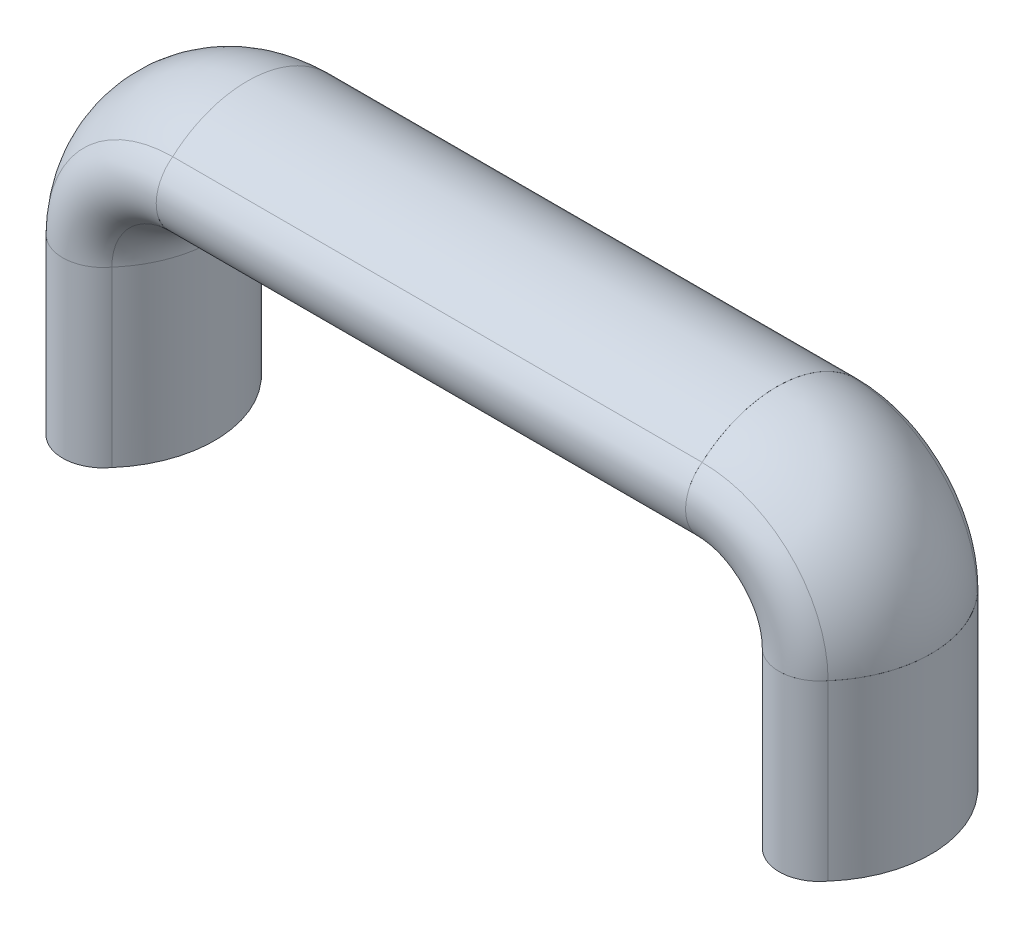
ISO-10303-21;
HEADER;
FILE_DESCRIPTION(('STEP AP214'),'2;1');
FILE_NAME('part.step','',(''),(''),'','','');
FILE_SCHEMA(('AUTOMOTIVE_DESIGN { 1 0 10303 214 1 1 1 1 }'));
ENDSEC;
DATA;
#1=APPLICATION_CONTEXT('core data for automotive mechanical design processes');
#2=APPLICATION_PROTOCOL_DEFINITION('international standard','automotive_design',2000,#1);
#3=PRODUCT_CONTEXT('',#1,'mechanical');
#4=PRODUCT('Part','Part','',(#3));
#5=PRODUCT_RELATED_PRODUCT_CATEGORY('part','',(#4));
#6=PRODUCT_DEFINITION_FORMATION('','',#4);
#7=PRODUCT_DEFINITION_CONTEXT('part definition',#1,'design');
#8=PRODUCT_DEFINITION('design','',#6,#7);
#9=PRODUCT_DEFINITION_SHAPE('','',#8);
#10=(LENGTH_UNIT() NAMED_UNIT(*) SI_UNIT(.MILLI.,.METRE.));
#11=(NAMED_UNIT(*) PLANE_ANGLE_UNIT() SI_UNIT($,.RADIAN.));
#12=(NAMED_UNIT(*) SI_UNIT($,.STERADIAN.) SOLID_ANGLE_UNIT());
#13=UNCERTAINTY_MEASURE_WITH_UNIT(LENGTH_MEASURE(1.E-05),#10,'distance_accuracy_value','');
#14=(GEOMETRIC_REPRESENTATION_CONTEXT(3) GLOBAL_UNCERTAINTY_ASSIGNED_CONTEXT((#13)) GLOBAL_UNIT_ASSIGNED_CONTEXT((#10,
#11,#12)) REPRESENTATION_CONTEXT('',''));
#15=CARTESIAN_POINT('',(0.,0.,0.));
#16=DIRECTION('',(0.,0.,1.));
#17=DIRECTION('',(1.,0.,0.));
#18=AXIS2_PLACEMENT_3D('',#15,#16,#17);
#19=CARTESIAN_POINT('',(0.,0.,0.));
#20=DIRECTION('',(0.,1.,0.));
#21=DIRECTION('',(0.,0.,1.00000000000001));
#22=AXIS2_PLACEMENT_3D('',#19,#20,#21);
#23=PLANE('',#22);
#24=CARTESIAN_POINT('',(58.5,0.,2.22044604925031E-13));
#25=DIRECTION('',(0.,-1.,0.));
#26=DIRECTION('',(0.,0.,-1.00000000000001));
#27=AXIS2_PLACEMENT_3D('',#24,#25,#26);
#28=CIRCLE('',#27,3.39999999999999);
#29=CARTESIAN_POINT('',(58.5,0.,-3.3999999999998));
#30=VERTEX_POINT('',#29);
#31=EDGE_CURVE('E650',#30,#30,#28,.T.);
#32=ORIENTED_EDGE('',*,*,#31,.F.);
#33=EDGE_LOOP('',(#32));
#34=FACE_BOUND('',#33,.T.);
#35=CARTESIAN_POINT('',(59.0000000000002,-1.66533453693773E-12,-8.33333333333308));
#36=DIRECTION('',(0.,1.,0.));
#37=DIRECTION('',(0.,0.,1.00000000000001));
#38=AXIS2_PLACEMENT_3D('',#35,#36,#37);
#39=CIRCLE('',#38,6.66666666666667);
#40=CARTESIAN_POINT('',(64.3671601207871,-1.66533453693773E-12,-12.2878290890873));
#41=VERTEX_POINT('',#40);
#42=CARTESIAN_POINT('',(53.632839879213,-1.66533453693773E-12,-12.2878290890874));
#43=VERTEX_POINT('',#42);
#44=EDGE_CURVE('E213',#41,#43,#39,.T.);
#45=ORIENTED_EDGE('',*,*,#44,.F.);
#46=CARTESIAN_POINT('',(50.3878794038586,1.66533453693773E-12,0.));
#47=DIRECTION('',(0.,1.,0.));
#48=DIRECTION('',(0.,0.,1.00000000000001));
#49=AXIS2_PLACEMENT_3D('',#46,#47,#48);
#50=CIRCLE('',#49,18.6121205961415);
#51=CARTESIAN_POINT('',(64.3671601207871,0.,12.2878290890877));
#52=VERTEX_POINT('',#51);
#53=EDGE_CURVE('E239',#52,#41,#50,.T.);
#54=ORIENTED_EDGE('',*,*,#53,.F.);
#55=CARTESIAN_POINT('',(58.9999999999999,0.,8.33333333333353));
#56=DIRECTION('',(0.,1.,0.));
#57=DIRECTION('',(0.,0.,1.00000000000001));
#58=AXIS2_PLACEMENT_3D('',#55,#56,#57);
#59=CIRCLE('',#58,6.66666666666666);
#60=CARTESIAN_POINT('',(53.632839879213,0.,12.2878290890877));
#61=VERTEX_POINT('',#60);
#62=EDGE_CURVE('E215',#61,#52,#59,.T.);
#63=ORIENTED_EDGE('',*,*,#62,.F.);
#64=CARTESIAN_POINT('',(67.6121205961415,0.,1.11022302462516E-13));
#65=DIRECTION('',(0.,1.,0.));
#66=DIRECTION('',(0.,0.,1.00000000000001));
#67=AXIS2_PLACEMENT_3D('',#64,#65,#66);
#68=CIRCLE('',#67,18.6121205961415);
#69=EDGE_CURVE('E49',#43,#61,#68,.T.);
#70=ORIENTED_EDGE('',*,*,#69,.F.);
#71=EDGE_LOOP('',(#45,#54,#63,#70));
#72=FACE_BOUND('',#71,.T.);
#73=ADVANCED_FACE('F45',(#34,#72),#23,.F.);
#74=CARTESIAN_POINT('',(0.,0.,0.));
#75=DIRECTION('',(0.,1.,0.));
#76=DIRECTION('',(0.,0.,1.00000000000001));
#77=AXIS2_PLACEMENT_3D('',#74,#75,#76);
#78=PLANE('',#77);
#79=CARTESIAN_POINT('',(-58.5,0.,1.11022302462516E-13));
#80=DIRECTION('',(0.,-1.,0.));
#81=DIRECTION('',(0.,0.,-1.00000000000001));
#82=AXIS2_PLACEMENT_3D('',#79,#80,#81);
#83=CIRCLE('',#82,3.39999999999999);
#84=CARTESIAN_POINT('',(-58.5,0.,-3.39999999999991));
#85=VERTEX_POINT('',#84);
#86=EDGE_CURVE('E220',#85,#85,#83,.T.);
#87=ORIENTED_EDGE('',*,*,#86,.F.);
#88=EDGE_LOOP('',(#87));
#89=FACE_BOUND('',#88,.T.);
#90=CARTESIAN_POINT('',(-58.9999999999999,-1.66533453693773E-12,-8.33333333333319));
#91=DIRECTION('',(0.,1.,0.));
#92=DIRECTION('',(0.,0.,1.00000000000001));
#93=AXIS2_PLACEMENT_3D('',#90,#91,#92);
#94=CIRCLE('',#93,6.66666666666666);
#95=CARTESIAN_POINT('',(-53.632839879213,-1.66533453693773E-12,-12.2878290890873));
#96=VERTEX_POINT('',#95);
#97=CARTESIAN_POINT('',(-64.3671601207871,-1.66533453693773E-12,-12.2878290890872));
#98=VERTEX_POINT('',#97);
#99=EDGE_CURVE('E409',#96,#98,#94,.T.);
#100=ORIENTED_EDGE('',*,*,#99,.F.);
#101=CARTESIAN_POINT('',(-67.6121205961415,0.,1.11022302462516E-13));
#102=DIRECTION('',(0.,1.,0.));
#103=DIRECTION('',(0.,0.,1.00000000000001));
#104=AXIS2_PLACEMENT_3D('',#101,#102,#103);
#105=CIRCLE('',#104,18.6121205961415);
#106=CARTESIAN_POINT('',(-53.632839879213,0.,12.2878290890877));
#107=VERTEX_POINT('',#106);
#108=EDGE_CURVE('E403',#107,#96,#105,.T.);
#109=ORIENTED_EDGE('',*,*,#108,.F.);
#110=CARTESIAN_POINT('',(-59.0000000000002,0.,8.33333333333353));
#111=DIRECTION('',(0.,1.,0.));
#112=DIRECTION('',(0.,0.,1.00000000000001));
#113=AXIS2_PLACEMENT_3D('',#110,#111,#112);
#114=CIRCLE('',#113,6.66666666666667);
#115=CARTESIAN_POINT('',(-64.3671601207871,0.,12.2878290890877));
#116=VERTEX_POINT('',#115);
#117=EDGE_CURVE('E397',#116,#107,#114,.T.);
#118=ORIENTED_EDGE('',*,*,#117,.F.);
#119=CARTESIAN_POINT('',(-50.3878794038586,0.,2.22044604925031E-13));
#120=DIRECTION('',(0.,1.,0.));
#121=DIRECTION('',(0.,0.,1.00000000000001));
#122=AXIS2_PLACEMENT_3D('',#119,#120,#121);
#123=CIRCLE('',#122,18.6121205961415);
#124=EDGE_CURVE('E229',#98,#116,#123,.T.);
#125=ORIENTED_EDGE('',*,*,#124,.F.);
#126=EDGE_LOOP('',(#100,#109,#118,#125));
#127=FACE_BOUND('',#126,.T.);
#128=ADVANCED_FACE('F786',(#89,#127),#78,.F.);
#129=CARTESIAN_POINT('',(67.6121205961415,0.,1.11022302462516E-13));
#130=DIRECTION('',(0.,1.,0.));
#131=DIRECTION('',(0.,0.,1.00000000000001));
#132=AXIS2_PLACEMENT_3D('',#129,#130,#131);
#133=CYLINDRICAL_SURFACE('',#132,18.6121205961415);
#134=ORIENTED_EDGE('',*,*,#69,.T.);
#135=DIRECTION('',(0.,1.,0.));
#136=VECTOR('',#135,1.);
#137=CARTESIAN_POINT('',(53.632839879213,0.,12.2878290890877));
#138=LINE('',#137,#136);
#139=CARTESIAN_POINT('',(53.6328398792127,28.6,12.2878290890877));
#140=VERTEX_POINT('',#139);
#141=EDGE_CURVE('E219',#140,#61,#138,.F.);
#142=ORIENTED_EDGE('',*,*,#141,.F.);
#143=CARTESIAN_POINT('',(67.6121205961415,28.6,1.11022302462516E-13));
#144=DIRECTION('',(0.,1.,0.));
#145=DIRECTION('',(0.,0.,1.00000000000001));
#146=AXIS2_PLACEMENT_3D('',#143,#144,#145);
#147=CIRCLE('',#146,18.6121205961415);
#148=CARTESIAN_POINT('',(53.6328398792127,28.5999999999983,-12.2878290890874));
#149=VERTEX_POINT('',#148);
#150=EDGE_CURVE('E225',#149,#140,#147,.T.);
#151=ORIENTED_EDGE('',*,*,#150,.F.);
#152=DIRECTION('',(0.,1.,0.));
#153=VECTOR('',#152,1.);
#154=CARTESIAN_POINT('',(53.632839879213,-1.66533453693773E-12,-12.2878290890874));
#155=LINE('',#154,#153);
#156=EDGE_CURVE('E222',#43,#149,#155,.T.);
#157=ORIENTED_EDGE('',*,*,#156,.F.);
#158=EDGE_LOOP('',(#134,#142,#151,#157));
#159=FACE_BOUND('',#158,.T.);
#160=ADVANCED_FACE('F223',(#159),#133,.T.);
#161=CARTESIAN_POINT('',(58.9999999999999,0.,8.33333333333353));
#162=DIRECTION('',(0.,1.,0.));
#163=DIRECTION('',(0.,0.,1.00000000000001));
#164=AXIS2_PLACEMENT_3D('',#161,#162,#163);
#165=CYLINDRICAL_SURFACE('',#164,6.66666666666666);
#166=ORIENTED_EDGE('',*,*,#62,.T.);
#167=DIRECTION('',(0.,1.,0.));
#168=VECTOR('',#167,1.);
#169=CARTESIAN_POINT('',(64.3671601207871,0.,12.2878290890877));
#170=LINE('',#169,#168);
#171=CARTESIAN_POINT('',(64.3671601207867,28.6,12.2878290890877));
#172=VERTEX_POINT('',#171);
#173=EDGE_CURVE('E245',#172,#52,#170,.F.);
#174=ORIENTED_EDGE('',*,*,#173,.F.);
#175=CARTESIAN_POINT('',(58.9999999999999,28.6,8.33333333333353));
#176=DIRECTION('',(0.,1.,0.));
#177=DIRECTION('',(0.,0.,1.00000000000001));
#178=AXIS2_PLACEMENT_3D('',#175,#176,#177);
#179=CIRCLE('',#178,6.66666666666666);
#180=CARTESIAN_POINT('',(58.9949999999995,28.6,14.9999981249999));
#181=VERTEX_POINT('',#180);
#182=EDGE_CURVE('E436',#181,#172,#179,.T.);
#183=ORIENTED_EDGE('',*,*,#182,.F.);
#184=CARTESIAN_POINT('',(58.9999999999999,28.6,8.33333333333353));
#185=DIRECTION('',(0.,1.,0.));
#186=DIRECTION('',(0.,0.,1.00000000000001));
#187=AXIS2_PLACEMENT_3D('',#184,#185,#186);
#188=CIRCLE('',#187,6.66666666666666);
#189=EDGE_CURVE('E432',#140,#181,#188,.T.);
#190=ORIENTED_EDGE('',*,*,#189,.F.);
#191=ORIENTED_EDGE('',*,*,#141,.T.);
#192=EDGE_LOOP('',(#166,#174,#183,#190,#191));
#193=FACE_BOUND('',#192,.T.);
#194=ADVANCED_FACE('F797',(#193),#165,.T.);
#195=CARTESIAN_POINT('',(50.3878794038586,1.66533453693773E-12,0.));
#196=DIRECTION('',(0.,1.,0.));
#197=DIRECTION('',(0.,0.,1.00000000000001));
#198=AXIS2_PLACEMENT_3D('',#195,#196,#197);
#199=CYLINDRICAL_SURFACE('',#198,18.6121205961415);
#200=ORIENTED_EDGE('',*,*,#53,.T.);
#201=DIRECTION('',(0.,1.,0.));
#202=VECTOR('',#201,1.);
#203=CARTESIAN_POINT('',(64.3671601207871,-1.66533453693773E-12,-12.2878290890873));
#204=LINE('',#203,#202);
#205=CARTESIAN_POINT('',(64.3671601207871,28.5999999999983,-12.2878290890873));
#206=VERTEX_POINT('',#205);
#207=EDGE_CURVE('E233',#206,#41,#204,.F.);
#208=ORIENTED_EDGE('',*,*,#207,.F.);
#209=CARTESIAN_POINT('',(50.3878794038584,28.6000000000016,0.));
#210=DIRECTION('',(0.,1.,0.));
#211=DIRECTION('',(0.,0.,1.00000000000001));
#212=AXIS2_PLACEMENT_3D('',#209,#210,#211);
#213=CIRCLE('',#212,18.6121205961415);
#214=EDGE_CURVE('E440',#172,#206,#213,.T.);
#215=ORIENTED_EDGE('',*,*,#214,.F.);
#216=ORIENTED_EDGE('',*,*,#173,.T.);
#217=EDGE_LOOP('',(#200,#208,#215,#216));
#218=FACE_BOUND('',#217,.T.);
#219=ADVANCED_FACE('F800',(#218),#199,.T.);
#220=CARTESIAN_POINT('',(59.0000000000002,-1.66533453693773E-12,-8.33333333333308));
#221=DIRECTION('',(0.,1.,0.));
#222=DIRECTION('',(0.,0.,1.00000000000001));
#223=AXIS2_PLACEMENT_3D('',#220,#221,#222);
#224=CYLINDRICAL_SURFACE('',#223,6.66666666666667);
#225=ORIENTED_EDGE('',*,*,#44,.T.);
#226=ORIENTED_EDGE('',*,*,#156,.T.);
#227=CARTESIAN_POINT('',(58.9999999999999,28.5999999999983,-8.33333333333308));
#228=DIRECTION('',(0.,1.,0.));
#229=DIRECTION('',(0.,0.,1.00000000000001));
#230=AXIS2_PLACEMENT_3D('',#227,#228,#229);
#231=CIRCLE('',#230,6.66666666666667);
#232=CARTESIAN_POINT('',(58.9949999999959,28.5999999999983,-14.9999981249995));
#233=VERTEX_POINT('',#232);
#234=EDGE_CURVE('E396',#233,#149,#231,.T.);
#235=ORIENTED_EDGE('',*,*,#234,.F.);
#236=CARTESIAN_POINT('',(58.9999999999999,28.5999999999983,-8.33333333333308));
#237=DIRECTION('',(0.,1.,0.));
#238=DIRECTION('',(0.,0.,1.00000000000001));
#239=AXIS2_PLACEMENT_3D('',#236,#237,#238);
#240=CIRCLE('',#239,6.66666666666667);
#241=EDGE_CURVE('E444',#206,#233,#240,.T.);
#242=ORIENTED_EDGE('',*,*,#241,.F.);
#243=ORIENTED_EDGE('',*,*,#207,.T.);
#244=EDGE_LOOP('',(#225,#226,#235,#242,#243));
#245=FACE_BOUND('',#244,.T.);
#246=ADVANCED_FACE('F231',(#245),#224,.T.);
#247=CARTESIAN_POINT('',(-50.3878794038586,0.,2.22044604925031E-13));
#248=DIRECTION('',(0.,1.,0.));
#249=DIRECTION('',(0.,0.,1.00000000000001));
#250=AXIS2_PLACEMENT_3D('',#247,#248,#249);
#251=CYLINDRICAL_SURFACE('',#250,18.6121205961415);
#252=ORIENTED_EDGE('',*,*,#124,.T.);
#253=DIRECTION('',(0.,1.,0.));
#254=VECTOR('',#253,1.);
#255=CARTESIAN_POINT('',(-64.3671601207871,0.,12.2878290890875));
#256=LINE('',#255,#254);
#257=CARTESIAN_POINT('',(-64.3671601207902,28.6,12.2878290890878));
#258=VERTEX_POINT('',#257);
#259=EDGE_CURVE('E402',#258,#116,#256,.F.);
#260=ORIENTED_EDGE('',*,*,#259,.F.);
#261=CARTESIAN_POINT('',(-50.3878794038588,28.6,2.22044604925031E-13));
#262=DIRECTION('',(0.,1.,0.));
#263=DIRECTION('',(0.,0.,1.00000000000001));
#264=AXIS2_PLACEMENT_3D('',#261,#262,#263);
#265=CIRCLE('',#264,18.6121205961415);
#266=CARTESIAN_POINT('',(-64.3671601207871,28.5999999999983,-12.2878290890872));
#267=VERTEX_POINT('',#266);
#268=EDGE_CURVE('E452',#267,#258,#265,.T.);
#269=ORIENTED_EDGE('',*,*,#268,.F.);
#270=DIRECTION('',(0.,1.,0.));
#271=VECTOR('',#270,1.);
#272=CARTESIAN_POINT('',(-64.3671601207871,-1.66533453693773E-12,-12.2878290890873));
#273=LINE('',#272,#271);
#274=EDGE_CURVE('E407',#98,#267,#273,.T.);
#275=ORIENTED_EDGE('',*,*,#274,.F.);
#276=EDGE_LOOP('',(#252,#260,#269,#275));
#277=FACE_BOUND('',#276,.T.);
#278=ADVANCED_FACE('F806',(#277),#251,.T.);
#279=CARTESIAN_POINT('',(-58.9999999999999,-1.66533453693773E-12,-8.33333333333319));
#280=DIRECTION('',(0.,1.,0.));
#281=DIRECTION('',(0.,0.,1.00000000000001));
#282=AXIS2_PLACEMENT_3D('',#279,#280,#281);
#283=CYLINDRICAL_SURFACE('',#282,6.66666666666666);
#284=ORIENTED_EDGE('',*,*,#99,.T.);
#285=ORIENTED_EDGE('',*,*,#274,.T.);
#286=CARTESIAN_POINT('',(-58.9999999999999,28.5999999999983,-8.33333333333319));
#287=DIRECTION('',(0.,1.,0.));
#288=DIRECTION('',(0.,0.,1.00000000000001));
#289=AXIS2_PLACEMENT_3D('',#286,#287,#288);
#290=CIRCLE('',#289,6.66666666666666);
#291=CARTESIAN_POINT('',(-58.9949999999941,28.5999999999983,-14.9999981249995));
#292=VERTEX_POINT('',#291);
#293=EDGE_CURVE('E448',#292,#267,#290,.T.);
#294=ORIENTED_EDGE('',*,*,#293,.F.);
#295=CARTESIAN_POINT('',(-58.9999999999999,28.5999999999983,-8.33333333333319));
#296=DIRECTION('',(0.,1.,0.));
#297=DIRECTION('',(0.,0.,1.00000000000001));
#298=AXIS2_PLACEMENT_3D('',#295,#296,#297);
#299=CIRCLE('',#298,6.66666666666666);
#300=CARTESIAN_POINT('',(-53.632839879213,28.5999999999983,-12.2878290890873));
#301=VERTEX_POINT('',#300);
#302=EDGE_CURVE('E459',#292,#301,#299,.F.);
#303=ORIENTED_EDGE('',*,*,#302,.T.);
#304=DIRECTION('',(0.,1.,0.));
#305=VECTOR('',#304,1.);
#306=CARTESIAN_POINT('',(-53.632839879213,-1.66533453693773E-12,-12.2878290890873));
#307=LINE('',#306,#305);
#308=EDGE_CURVE('E398',#96,#301,#307,.T.);
#309=ORIENTED_EDGE('',*,*,#308,.F.);
#310=EDGE_LOOP('',(#284,#285,#294,#303,#309));
#311=FACE_BOUND('',#310,.T.);
#312=ADVANCED_FACE('F809',(#311),#283,.T.);
#313=CARTESIAN_POINT('',(-67.6121205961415,0.,1.11022302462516E-13));
#314=DIRECTION('',(0.,1.,0.));
#315=DIRECTION('',(0.,0.,1.00000000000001));
#316=AXIS2_PLACEMENT_3D('',#313,#314,#315);
#317=CYLINDRICAL_SURFACE('',#316,18.6121205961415);
#318=ORIENTED_EDGE('',*,*,#108,.T.);
#319=ORIENTED_EDGE('',*,*,#308,.T.);
#320=CARTESIAN_POINT('',(-67.6121205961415,28.6,1.11022302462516E-13));
#321=DIRECTION('',(0.,1.,0.));
#322=DIRECTION('',(0.,0.,1.00000000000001));
#323=AXIS2_PLACEMENT_3D('',#320,#321,#322);
#324=CIRCLE('',#323,18.6121205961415);
#325=CARTESIAN_POINT('',(-53.6328398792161,28.6,12.2878290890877));
#326=VERTEX_POINT('',#325);
#327=EDGE_CURVE('E462',#301,#326,#324,.F.);
#328=ORIENTED_EDGE('',*,*,#327,.T.);
#329=DIRECTION('',(0.,1.,0.));
#330=VECTOR('',#329,1.);
#331=CARTESIAN_POINT('',(-53.632839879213,0.,12.2878290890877));
#332=LINE('',#331,#330);
#333=EDGE_CURVE('E392',#107,#326,#332,.T.);
#334=ORIENTED_EDGE('',*,*,#333,.F.);
#335=EDGE_LOOP('',(#318,#319,#328,#334));
#336=FACE_BOUND('',#335,.T.);
#337=ADVANCED_FACE('F812',(#336),#317,.T.);
#338=CARTESIAN_POINT('',(-59.0000000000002,0.,8.33333333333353));
#339=DIRECTION('',(0.,1.,0.));
#340=DIRECTION('',(0.,0.,1.00000000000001));
#341=AXIS2_PLACEMENT_3D('',#338,#339,#340);
#342=CYLINDRICAL_SURFACE('',#341,6.66666666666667);
#343=ORIENTED_EDGE('',*,*,#117,.T.);
#344=ORIENTED_EDGE('',*,*,#333,.T.);
#345=CARTESIAN_POINT('',(-59.0000000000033,28.6,8.33333333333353));
#346=DIRECTION('',(0.,1.,0.));
#347=DIRECTION('',(0.,0.,1.00000000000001));
#348=AXIS2_PLACEMENT_3D('',#345,#346,#347);
#349=CIRCLE('',#348,6.66666666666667);
#350=CARTESIAN_POINT('',(-58.9950000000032,28.6,14.9999981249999));
#351=VERTEX_POINT('',#350);
#352=EDGE_CURVE('E464',#326,#351,#349,.F.);
#353=ORIENTED_EDGE('',*,*,#352,.T.);
#354=CARTESIAN_POINT('',(-59.0000000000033,28.6,8.33333333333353));
#355=DIRECTION('',(0.,1.,0.));
#356=DIRECTION('',(0.,0.,1.00000000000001));
#357=AXIS2_PLACEMENT_3D('',#354,#355,#356);
#358=CIRCLE('',#357,6.66666666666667);
#359=EDGE_CURVE('E455',#258,#351,#358,.T.);
#360=ORIENTED_EDGE('',*,*,#359,.F.);
#361=ORIENTED_EDGE('',*,*,#259,.T.);
#362=EDGE_LOOP('',(#343,#344,#353,#360,#361));
#363=FACE_BOUND('',#362,.T.);
#364=ADVANCED_FACE('F492',(#363),#342,.T.);
#365=CARTESIAN_POINT('',(58.9899999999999,28.6,3.33066907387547E-13));
#366=DIRECTION('',(0.,-1.,0.));
#367=DIRECTION('',(0.,0.,-1.00000000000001));
#368=AXIS2_PLACEMENT_3D('',#365,#366,#367);
#369=PLANE('',#368);
#370=CARTESIAN_POINT('',(53.6228398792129,28.5999999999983,-12.2878290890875));
#371=CARTESIAN_POINT('',(53.3924332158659,28.5999999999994,-12.0257231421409));
#372=CARTESIAN_POINT('',(53.1694157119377,28.5999999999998,-11.7571237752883));
#373=CARTESIAN_POINT('',(52.7388360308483,28.6000000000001,-11.2078307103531));
#374=CARTESIAN_POINT('',(52.5312731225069,28.6,-10.9271375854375));
#375=CARTESIAN_POINT('',(52.1322609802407,28.5999999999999,-10.3545292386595));
#376=CARTESIAN_POINT('',(51.9408114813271,28.5999999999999,-10.0626142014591));
#377=CARTESIAN_POINT('',(51.5747493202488,28.6,-9.4686854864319));
#378=CARTESIAN_POINT('',(51.4001253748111,28.6,-9.16667876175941));
#379=CARTESIAN_POINT('',(51.0681201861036,28.6,-8.55333033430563));
#380=CARTESIAN_POINT('',(50.9107387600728,28.6,-8.24198873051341));
#381=CARTESIAN_POINT('',(50.61372136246,28.6,-7.61097564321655));
#382=CARTESIAN_POINT('',(50.4740852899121,28.6,-7.29130420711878));
#383=CARTESIAN_POINT('',(50.1476411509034,28.6,-6.48273651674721));
#384=CARTESIAN_POINT('',(49.9721933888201,28.6,-5.98920639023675));
#385=CARTESIAN_POINT('',(49.6634880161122,28.6,-4.98903058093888));
#386=CARTESIAN_POINT('',(49.5302359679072,28.6,-4.48238317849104));
#387=CARTESIAN_POINT('',(49.3627536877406,28.6,-3.7155131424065));
#388=CARTESIAN_POINT('',(49.3123250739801,28.6,-3.45873628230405));
#389=CARTESIAN_POINT('',(49.222346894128,28.6,-2.94335909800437));
#390=CARTESIAN_POINT('',(49.1827942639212,28.6,-2.68475930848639));
#391=CARTESIAN_POINT('',(49.0805424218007,28.6,-1.90675373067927));
#392=CARTESIAN_POINT('',(49.0342394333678,28.6,-1.38509671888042));
#393=CARTESIAN_POINT('',(48.9857491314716,28.6,-0.339863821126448));
#394=CARTESIAN_POINT('',(48.9835564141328,28.6,0.183711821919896));
#395=CARTESIAN_POINT('',(49.0232677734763,28.5999999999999,1.22919317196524));
#396=CARTESIAN_POINT('',(49.065172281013,28.5999999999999,1.75109886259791));
#397=CARTESIAN_POINT('',(49.1928402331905,28.6,2.78986125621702));
#398=CARTESIAN_POINT('',(49.2786267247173,28.6000000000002,3.30671516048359));
#399=CARTESIAN_POINT('',(49.4396944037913,28.5999999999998,4.07502677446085));
#400=CARTESIAN_POINT('',(49.4987838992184,28.5999999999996,4.32997671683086));
#401=CARTESIAN_POINT('',(49.6276729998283,28.6000000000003,4.83722639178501));
#402=CARTESIAN_POINT('',(49.6974753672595,28.6000000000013,5.08952542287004));
#403=CARTESIAN_POINT('',(49.9228259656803,28.6000000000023,5.84189054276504));
#404=CARTESIAN_POINT('',(50.094287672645,28.6000000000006,6.33728152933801));
#405=CARTESIAN_POINT('',(50.4783808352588,28.5999999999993,7.31183220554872));
#406=CARTESIAN_POINT('',(50.6910119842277,28.5999999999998,7.79099201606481));
#407=CARTESIAN_POINT('',(51.0394712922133,28.6,8.49459328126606));
#408=CARTESIAN_POINT('',(51.1604662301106,28.6,8.72647680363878));
#409=CARTESIAN_POINT('',(51.4120826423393,28.5999999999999,9.18488240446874));
#410=CARTESIAN_POINT('',(51.5427018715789,28.5999999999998,9.41140571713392));
#411=CARTESIAN_POINT('',(51.9486102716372,28.6000000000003,10.0822415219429));
#412=CARTESIAN_POINT('',(52.2380958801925,28.600000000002,10.5181140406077));
#413=CARTESIAN_POINT('',(52.7145082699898,28.6000000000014,11.1737633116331));
#414=CARTESIAN_POINT('',(52.8890845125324,28.6000000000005,11.4026514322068));
#415=CARTESIAN_POINT('',(53.2483873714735,28.5999999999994,11.8517471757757));
#416=CARTESIAN_POINT('',(53.4330981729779,28.5999999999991,12.0719674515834));
#417=CARTESIAN_POINT('',(53.6228398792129,28.6,12.2878290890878));
#418=B_SPLINE_CURVE_WITH_KNOTS('',3,(#370,#371,#372,#373,#374,#375,#376,#377,#378,#379,#380,
#381,#382,#383,#384,#385,#386,#387,#388,#389,#390,#391,#392,#393,#394,#395,#396,#397,#398,#399,
#400,#401,#402,#403,#404,#405,#406,#407,#408,#409,#410,#411,#412,#413,#414,#415,#416,#417),
.UNSPECIFIED.,.F.,.F.,(4,2,2,2,2,2,2,2,2,2,2,2,2,2,2,2,2,2,2,2,2,2,2,4),(0.,1.04679859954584,
2.09354764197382,3.14027946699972,4.18630439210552,5.23231822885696,6.27832611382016,
7.84775945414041,9.41739959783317,10.20224194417,10.9868629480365,12.5559671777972,
14.1248791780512,15.6938065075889,17.2635586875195,18.0484822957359,18.8336086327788,
20.4042986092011,21.9749768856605,22.7594272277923,23.5436951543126,25.1112491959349,
25.974584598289,26.8366091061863),.UNSPECIFIED.);
#419=CARTESIAN_POINT('',(53.6228398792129,28.5999999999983,-12.2878290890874));
#420=VERTEX_POINT('',#419);
#421=CARTESIAN_POINT('',(53.6228398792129,28.6,12.2878290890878));
#422=VERTEX_POINT('',#421);
#423=EDGE_CURVE('E467',#420,#422,#418,.T.);
#424=ORIENTED_EDGE('',*,*,#423,.F.);
#425=CARTESIAN_POINT('',(58.9949999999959,28.5999999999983,-14.9999981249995));
#426=CARTESIAN_POINT('',(58.8074785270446,28.5999999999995,-15.0001589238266));
#427=CARTESIAN_POINT('',(58.619953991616,28.5999999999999,-14.9923682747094));
#428=CARTESIAN_POINT('',(58.2462329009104,28.6000000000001,-14.9610285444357));
#429=CARTESIAN_POINT('',(58.0600362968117,28.5999999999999,-14.937480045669));
#430=CARTESIAN_POINT('',(57.6904612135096,28.6,-14.874797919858));
#431=CARTESIAN_POINT('',(57.507080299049,28.6000000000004,-14.835678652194));
#432=CARTESIAN_POINT('',(57.144268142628,28.5999999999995,-14.7421404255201));
#433=CARTESIAN_POINT('',(56.9648368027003,28.5999999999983,-14.6877218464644));
#434=CARTESIAN_POINT('',(56.6110575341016,28.5999999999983,-14.563921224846));
#435=CARTESIAN_POINT('',(56.4367136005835,28.5999999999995,-14.4945277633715));
#436=CARTESIAN_POINT('',(56.0944930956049,28.6000000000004,-14.3412978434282));
#437=CARTESIAN_POINT('',(55.9266166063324,28.6,-14.2574612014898));
#438=CARTESIAN_POINT('',(55.5985986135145,28.5999999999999,-14.0759758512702));
#439=CARTESIAN_POINT('',(55.4384533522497,28.6000000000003,-13.9783339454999));
#440=CARTESIAN_POINT('',(55.1270086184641,28.5999999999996,-13.7699573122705));
#441=CARTESIAN_POINT('',(54.9757077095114,28.5999999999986,-13.6592247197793));
#442=CARTESIAN_POINT('',(54.6020152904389,28.5999999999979,-13.3607080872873));
#443=CARTESIAN_POINT('',(54.3865009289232,28.5999999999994,-13.1641404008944));
#444=CARTESIAN_POINT('',(54.0840495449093,28.6000000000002,-12.8496727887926));
#445=CARTESIAN_POINT('',(53.98669293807,28.6000000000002,-12.7415680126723));
#446=CARTESIAN_POINT('',(53.7992369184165,28.5999999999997,-12.5192077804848));
#447=CARTESIAN_POINT('',(53.7091387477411,28.5999999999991,-12.4049512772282));
#448=CARTESIAN_POINT('',(53.6228398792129,28.5999999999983,-12.2878290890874));
#449=B_SPLINE_CURVE_WITH_KNOTS('',3,(#425,#426,#427,#428,#429,#430,#431,#432,#433,#434,#435,
#436,#437,#438,#439,#440,#441,#442,#443,#444,#445,#446,#447,#448),.UNSPECIFIED.,.F.,.F.,(4,2,2,
2,2,2,2,2,2,2,2,4),(0.,0.562392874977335,1.124764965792,1.6866196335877,2.24846034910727,
2.81073101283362,3.3730088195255,3.93501052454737,4.49692069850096,5.36910580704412,
5.80529374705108,6.2415561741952),.UNSPECIFIED.);
#450=EDGE_CURVE('E386',#233,#420,#449,.T.);
#451=ORIENTED_EDGE('',*,*,#450,.F.);
#452=ORIENTED_EDGE('',*,*,#234,.T.);
#453=ORIENTED_EDGE('',*,*,#150,.T.);
#454=ORIENTED_EDGE('',*,*,#189,.T.);
#455=CARTESIAN_POINT('',(53.6228398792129,28.6,12.2878290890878));
#456=CARTESIAN_POINT('',(53.7340566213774,28.6,12.4388097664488));
#457=CARTESIAN_POINT('',(53.8516731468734,28.6,12.5850715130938));
#458=CARTESIAN_POINT('',(54.0987973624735,28.6,12.8671694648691));
#459=CARTESIAN_POINT('',(54.2283046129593,28.6,13.0030060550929));
#460=CARTESIAN_POINT('',(54.4981860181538,28.6,13.2631575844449));
#461=CARTESIAN_POINT('',(54.6385500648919,28.6,13.3874830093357));
#462=CARTESIAN_POINT('',(54.9292435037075,28.6,13.6238712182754));
#463=CARTESIAN_POINT('',(55.0795726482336,28.6,13.7359343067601));
#464=CARTESIAN_POINT('',(55.3892525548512,28.6,13.9470852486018));
#465=CARTESIAN_POINT('',(55.5486101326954,28.6,14.0461631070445));
#466=CARTESIAN_POINT('',(55.8751063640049,28.6,14.2305390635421));
#467=CARTESIAN_POINT('',(56.0422451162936,28.6,14.3158369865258));
#468=CARTESIAN_POINT('',(56.383043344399,28.6,14.4720077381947));
#469=CARTESIAN_POINT('',(56.5566995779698,28.6,14.5428876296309));
#470=CARTESIAN_POINT('',(56.9092944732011,28.6,14.669755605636));
#471=CARTESIAN_POINT('',(57.0882322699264,28.6,14.7257461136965));
#472=CARTESIAN_POINT('',(57.5503177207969,28.6,14.8491772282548));
#473=CARTESIAN_POINT('',(57.8364494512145,28.6,14.9058687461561));
#474=CARTESIAN_POINT('',(58.2690681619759,28.6,14.9625059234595));
#475=CARTESIAN_POINT('',(58.413860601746,28.6,14.976651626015));
#476=CARTESIAN_POINT('',(58.7040853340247,28.6,14.9954515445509));
#477=CARTESIAN_POINT('',(58.8495177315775,28.6,15.0001041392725));
#478=CARTESIAN_POINT('',(58.9949999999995,28.6,14.9999981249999));
#479=B_SPLINE_CURVE_WITH_KNOTS('',3,(#455,#456,#457,#458,#459,#460,#461,#462,#463,#464,#465,
#466,#467,#468,#469,#470,#471,#472,#473,#474,#475,#476,#477,#478),.UNSPECIFIED.,.F.,.F.,(4,2,2,
2,2,2,2,2,2,2,2,4),(0.,0.562392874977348,1.12476496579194,1.68661963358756,2.24846034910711,
2.81073101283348,3.37300881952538,3.93501052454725,4.49692069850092,5.36910580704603,
5.80529374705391,6.24155617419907),.UNSPECIFIED.);
#480=EDGE_CURVE('E385',#422,#181,#479,.T.);
#481=ORIENTED_EDGE('',*,*,#480,.F.);
#482=EDGE_LOOP('',(#424,#451,#452,#453,#454,#481));
#483=FACE_BOUND('',#482,.T.);
#484=ADVANCED_FACE('F486',(#483),#369,.T.);
#485=CARTESIAN_POINT('',(0.,28.6,0.));
#486=DIRECTION('',(0.,1.,0.));
#487=DIRECTION('',(0.,0.,1.00000000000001));
#488=AXIS2_PLACEMENT_3D('',#485,#486,#487);
#489=PLANE('',#488);
#490=ORIENTED_EDGE('',*,*,#214,.T.);
#491=ORIENTED_EDGE('',*,*,#241,.T.);
#492=CARTESIAN_POINT('',(64.3571601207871,28.5999999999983,-12.2878290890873));
#493=CARTESIAN_POINT('',(64.2459441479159,28.5999999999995,-12.4388087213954));
#494=CARTESIAN_POINT('',(64.1283284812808,28.5999999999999,-12.5850694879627));
#495=CARTESIAN_POINT('',(63.8812061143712,28.6000000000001,-12.8671656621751));
#496=CARTESIAN_POINT('',(63.7516998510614,28.5999999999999,-13.0030014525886));
#497=CARTESIAN_POINT('',(63.481818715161,28.6,-13.2631533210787));
#498=CARTESIAN_POINT('',(63.3414538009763,28.6000000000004,-13.3874797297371));
#499=CARTESIAN_POINT('',(63.050758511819,28.5999999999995,-13.6238697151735));
#500=CARTESIAN_POINT('',(62.9004283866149,28.5999999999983,-13.7359335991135));
#501=CARTESIAN_POINT('',(62.5907464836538,28.5999999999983,-13.9470859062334));
#502=CARTESIAN_POINT('',(62.4313878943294,28.5999999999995,-14.0461643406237));
#503=CARTESIAN_POINT('',(62.1048895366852,28.6000000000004,-14.2305412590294));
#504=CARTESIAN_POINT('',(61.9377496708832,28.6,-14.3158395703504));
#505=CARTESIAN_POINT('',(61.5969511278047,28.5999999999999,-14.4720100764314));
#506=CARTESIAN_POINT('',(61.4232957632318,28.6000000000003,-14.5428894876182));
#507=CARTESIAN_POINT('',(61.0707026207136,28.5999999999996,-14.669756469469));
#508=CARTESIAN_POINT('',(60.8917657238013,28.5999999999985,-14.7257465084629));
#509=CARTESIAN_POINT('',(60.4312872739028,28.5999999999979,-14.8487487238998));
#510=CARTESIAN_POINT('',(60.1468211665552,28.5999999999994,-14.9052208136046));
#511=CARTESIAN_POINT('',(59.7167211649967,28.6000000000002,-14.96185534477));
#512=CARTESIAN_POINT('',(59.5727742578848,28.6000000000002,-14.976054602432));
#513=CARTESIAN_POINT('',(59.2842369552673,28.5999999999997,-14.9950710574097));
#514=CARTESIAN_POINT('',(59.1396464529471,28.5999999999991,-14.9998866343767));
#515=CARTESIAN_POINT('',(58.9949999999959,28.5999999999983,-14.9999981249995));
#516=B_SPLINE_CURVE_WITH_KNOTS('',3,(#492,#493,#494,#495,#496,#497,#498,#499,#500,#501,#502,
#503,#504,#505,#506,#507,#508,#509,#510,#511,#512,#513,#514,#515),.UNSPECIFIED.,.F.,.F.,(4,2,2,
2,2,2,2,2,2,2,2,4),(0.,0.562388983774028,1.12475730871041,1.6866158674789,2.24846034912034,
2.81073451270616,3.37301572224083,3.93501482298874,4.49692069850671,5.36412763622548,
5.79781111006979,6.23156946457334),.UNSPECIFIED.);
#517=CARTESIAN_POINT('',(64.3571601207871,28.5999999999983,-12.2878290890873));
#518=VERTEX_POINT('',#517);
#519=EDGE_CURVE('E702',#518,#233,#516,.T.);
#520=ORIENTED_EDGE('',*,*,#519,.F.);
#521=CARTESIAN_POINT('',(64.3571601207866,28.6,12.2878290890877));
#522=CARTESIAN_POINT('',(64.5875667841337,28.6,12.0257231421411));
#523=CARTESIAN_POINT('',(64.8105842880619,28.6,11.7571237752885));
#524=CARTESIAN_POINT('',(65.2411639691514,28.6,11.2078307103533));
#525=CARTESIAN_POINT('',(65.4487268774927,28.6,10.9271375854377));
#526=CARTESIAN_POINT('',(65.8477390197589,28.6,10.3545292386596));
#527=CARTESIAN_POINT('',(66.0391885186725,28.6,10.0626142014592));
#528=CARTESIAN_POINT('',(66.4052506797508,28.6,9.46868548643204));
#529=CARTESIAN_POINT('',(66.5798746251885,28.6,9.16667876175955));
#530=CARTESIAN_POINT('',(66.911879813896,28.6,8.55333033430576));
#531=CARTESIAN_POINT('',(67.0692612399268,28.6,8.24198873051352));
#532=CARTESIAN_POINT('',(67.3662786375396,28.6,7.61097564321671));
#533=CARTESIAN_POINT('',(67.5059147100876,28.6,7.29130420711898));
#534=CARTESIAN_POINT('',(67.8323588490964,28.6,6.48273651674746));
#535=CARTESIAN_POINT('',(68.0078066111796,28.6,5.98920639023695));
#536=CARTESIAN_POINT('',(68.3165119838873,28.6,4.98903058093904));
#537=CARTESIAN_POINT('',(68.4497640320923,28.6,4.48238317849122));
#538=CARTESIAN_POINT('',(68.617246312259,28.6,3.71551314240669));
#539=CARTESIAN_POINT('',(68.6676749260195,28.6,3.45873628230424));
#540=CARTESIAN_POINT('',(68.7576531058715,28.6,2.94335909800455));
#541=CARTESIAN_POINT('',(68.7972057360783,28.6,2.68475930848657));
#542=CARTESIAN_POINT('',(68.8994575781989,28.6,1.90675373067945));
#543=CARTESIAN_POINT('',(68.945760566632,28.6,1.38509671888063));
#544=CARTESIAN_POINT('',(68.9942508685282,28.6,0.339863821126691));
#545=CARTESIAN_POINT('',(68.9964435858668,28.6,-0.183711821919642));
#546=CARTESIAN_POINT('',(68.9567322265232,28.6,-1.22919317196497));
#547=CARTESIAN_POINT('',(68.9148277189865,28.6,-1.75109886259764));
#548=CARTESIAN_POINT('',(68.787159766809,28.6,-2.78986125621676));
#549=CARTESIAN_POINT('',(68.7013732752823,28.6,-3.30671516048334));
#550=CARTESIAN_POINT('',(68.5403055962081,28.6,-4.07502677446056));
#551=CARTESIAN_POINT('',(68.481216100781,28.6,-4.32997671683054));
#552=CARTESIAN_POINT('',(68.3523270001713,28.6,-4.83722639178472));
#553=CARTESIAN_POINT('',(68.2825246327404,28.6,-5.0895254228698));
#554=CARTESIAN_POINT('',(68.0571740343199,28.6,-5.84189054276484));
#555=CARTESIAN_POINT('',(67.8857123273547,28.5999999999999,-6.33728152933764));
#556=CARTESIAN_POINT('',(67.5016191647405,28.6,-7.31183220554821));
#557=CARTESIAN_POINT('',(67.2889880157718,28.6,-7.79099201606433));
#558=CARTESIAN_POINT('',(66.9405287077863,28.5999999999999,-8.49459328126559));
#559=CARTESIAN_POINT('',(66.819533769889,28.5999999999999,-8.72647680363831));
#560=CARTESIAN_POINT('',(66.5679173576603,28.6,-9.18488240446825));
#561=CARTESIAN_POINT('',(66.4372981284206,28.6000000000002,-9.41140571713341));
#562=CARTESIAN_POINT('',(66.0313897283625,28.5999999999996,-10.0822415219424));
#563=CARTESIAN_POINT('',(65.7419041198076,28.5999999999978,-10.5181140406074));
#564=CARTESIAN_POINT('',(65.2654917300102,28.5999999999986,-11.1737633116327));
#565=CARTESIAN_POINT('',(65.0909154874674,28.5999999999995,-11.4026514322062));
#566=CARTESIAN_POINT('',(64.7316126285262,28.6000000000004,-11.851747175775));
#567=CARTESIAN_POINT('',(64.5469018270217,28.6000000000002,-12.0719674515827));
#568=CARTESIAN_POINT('',(64.3571601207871,28.5999999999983,-12.2878290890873));
#569=B_SPLINE_CURVE_WITH_KNOTS('',3,(#521,#522,#523,#524,#525,#526,#527,#528,#529,#530,#531,
#532,#533,#534,#535,#536,#537,#538,#539,#540,#541,#542,#543,#544,#545,#546,#547,#548,#549,#550,
#551,#552,#553,#554,#555,#556,#557,#558,#559,#560,#561,#562,#563,#564,#565,#566,#567,#568),
.UNSPECIFIED.,.F.,.F.,(4,2,2,2,2,2,2,2,2,2,2,2,2,2,2,2,2,2,2,2,2,2,2,4),(0.,1.04679859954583,
2.09354764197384,3.14027946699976,4.18630439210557,5.232318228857,6.27832611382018,
7.84775945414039,9.41739959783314,10.20224194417,10.9868629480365,12.5559671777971,
14.1248791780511,15.6938065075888,17.2635586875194,18.0484822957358,18.8336086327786,
20.4042986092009,21.9749768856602,22.759427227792,23.5436951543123,25.1112491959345,
25.9745845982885,26.8366091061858),.UNSPECIFIED.);
#570=CARTESIAN_POINT('',(64.3571601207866,28.6,12.2878290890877));
#571=VERTEX_POINT('',#570);
#572=EDGE_CURVE('E369',#571,#518,#569,.T.);
#573=ORIENTED_EDGE('',*,*,#572,.F.);
#574=CARTESIAN_POINT('',(58.9949999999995,28.6,14.9999981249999));
#575=CARTESIAN_POINT('',(59.1825202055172,28.6,14.9998776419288));
#576=CARTESIAN_POINT('',(59.3700315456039,28.6,14.9918058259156));
#577=CARTESIAN_POINT('',(59.7437026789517,28.6,14.9599059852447));
#578=CARTESIAN_POINT('',(59.9298625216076,28.6,14.9360785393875));
#579=CARTESIAN_POINT('',(60.2993432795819,28.6,14.8728425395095));
#580=CARTESIAN_POINT('',(60.4826666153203,28.6,14.8334481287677));
#581=CARTESIAN_POINT('',(60.8453405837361,28.6,14.7393653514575));
#582=CARTESIAN_POINT('',(61.0246913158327,28.6,14.6846773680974));
#583=CARTESIAN_POINT('',(61.3782867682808,28.6,14.5603454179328));
#584=CARTESIAN_POINT('',(61.5525274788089,28.6,14.4906900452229));
#585=CARTESIAN_POINT('',(61.8945197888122,28.6,14.3369458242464));
#586=CARTESIAN_POINT('',(62.062271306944,28.6,14.2528567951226));
#587=CARTESIAN_POINT('',(62.3900166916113,28.6,14.0708792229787));
#588=CARTESIAN_POINT('',(62.550014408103,28.6,13.9729976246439));
#589=CARTESIAN_POINT('',(62.8611443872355,28.6,13.7641548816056));
#590=CARTESIAN_POINT('',(63.0122781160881,28.6,13.6531959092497));
#591=CARTESIAN_POINT('',(63.3842245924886,28.6,13.3551593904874));
#592=CARTESIAN_POINT('',(63.5982801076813,28.6,13.1594803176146));
#593=CARTESIAN_POINT('',(63.8987648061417,28.6,12.8465866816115));
#594=CARTESIAN_POINT('',(63.9955012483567,28.6,12.7390488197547));
#595=CARTESIAN_POINT('',(64.1817980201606,28.6,12.5178952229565));
#596=CARTESIAN_POINT('',(64.2713571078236,28.6,12.4042784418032));
#597=CARTESIAN_POINT('',(64.3571601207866,28.6,12.2878290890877));
#598=B_SPLINE_CURVE_WITH_KNOTS('',3,(#574,#575,#576,#577,#578,#579,#580,#581,#582,#583,#584,
#585,#586,#587,#588,#589,#590,#591,#592,#593,#594,#595,#596,#597),.UNSPECIFIED.,.F.,.F.,(4,2,2,
2,2,2,2,2,2,2,2,4),(0.,0.562388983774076,1.12475730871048,1.68661586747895,2.24846034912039,
2.81073451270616,3.3730157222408,3.9350148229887,4.49692069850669,5.36412763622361,
5.79781111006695,6.23156946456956),.UNSPECIFIED.);
#599=EDGE_CURVE('E391',#181,#571,#598,.T.);
#600=ORIENTED_EDGE('',*,*,#599,.F.);
#601=ORIENTED_EDGE('',*,*,#182,.T.);
#602=EDGE_LOOP('',(#490,#491,#520,#573,#600,#601));
#603=FACE_BOUND('',#602,.T.);
#604=ADVANCED_FACE('F491',(#603),#489,.T.);
#605=CARTESIAN_POINT('',(0.,28.6,0.));
#606=DIRECTION('',(0.,1.,0.));
#607=DIRECTION('',(0.,0.,1.00000000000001));
#608=AXIS2_PLACEMENT_3D('',#605,#606,#607);
#609=PLANE('',#608);
#610=ORIENTED_EDGE('',*,*,#268,.T.);
#611=ORIENTED_EDGE('',*,*,#359,.T.);
#612=CARTESIAN_POINT('',(-64.3571601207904,28.6000000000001,12.2878290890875));
#613=CARTESIAN_POINT('',(-64.2459441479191,28.6,12.4388087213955));
#614=CARTESIAN_POINT('',(-64.128328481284,28.6,12.5850694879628));
#615=CARTESIAN_POINT('',(-63.8812061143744,28.6,12.8671656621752));
#616=CARTESIAN_POINT('',(-63.7516998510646,28.6,13.0030014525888));
#617=CARTESIAN_POINT('',(-63.4818187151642,28.6,13.2631533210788));
#618=CARTESIAN_POINT('',(-63.3414538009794,28.5999999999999,13.3874797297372));
#619=CARTESIAN_POINT('',(-63.0507585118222,28.6,13.6238697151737));
#620=CARTESIAN_POINT('',(-62.9004283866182,28.6000000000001,13.7359335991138));
#621=CARTESIAN_POINT('',(-62.5907464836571,28.6000000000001,13.9470859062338));
#622=CARTESIAN_POINT('',(-62.4313878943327,28.6,14.046164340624));
#623=CARTESIAN_POINT('',(-62.1048895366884,28.5999999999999,14.2305412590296));
#624=CARTESIAN_POINT('',(-61.9377496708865,28.6,14.3158395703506));
#625=CARTESIAN_POINT('',(-61.5969511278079,28.6,14.4720100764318));
#626=CARTESIAN_POINT('',(-61.4232957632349,28.6,14.5428894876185));
#627=CARTESIAN_POINT('',(-61.0707026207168,28.6,14.6697564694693));
#628=CARTESIAN_POINT('',(-60.8917657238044,28.6,14.7257465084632));
#629=CARTESIAN_POINT('',(-60.4312872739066,28.6,14.8487487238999));
#630=CARTESIAN_POINT('',(-60.1468211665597,28.6,14.9052208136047));
#631=CARTESIAN_POINT('',(-59.7167211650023,28.6,14.9618553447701));
#632=CARTESIAN_POINT('',(-59.5727742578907,28.6,14.9760546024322));
#633=CARTESIAN_POINT('',(-59.2842369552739,28.6,14.99507105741));
#634=CARTESIAN_POINT('',(-59.139646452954,28.6,14.999886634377));
#635=CARTESIAN_POINT('',(-58.9950000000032,28.6,14.9999981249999));
#636=B_SPLINE_CURVE_WITH_KNOTS('',3,(#612,#613,#614,#615,#616,#617,#618,#619,#620,#621,#622,
#623,#624,#625,#626,#627,#628,#629,#630,#631,#632,#633,#634,#635),.UNSPECIFIED.,.F.,.F.,(4,2,2,
2,2,2,2,2,2,2,2,4),(0.,0.562388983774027,1.12475730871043,1.68661586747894,2.24846034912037,
2.81073451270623,3.37301572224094,3.9350148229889,4.49692069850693,5.3641276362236,
5.79781111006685,6.23156946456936),.UNSPECIFIED.);
#637=CARTESIAN_POINT('',(-64.3571601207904,28.6000000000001,12.2878290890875));
#638=VERTEX_POINT('',#637);
#639=EDGE_CURVE('E377',#638,#351,#636,.T.);
#640=ORIENTED_EDGE('',*,*,#639,.F.);
#641=CARTESIAN_POINT('',(-64.3571601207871,28.5999999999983,-12.2878290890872));
#642=CARTESIAN_POINT('',(-64.5875667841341,28.5999999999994,-12.0257231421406));
#643=CARTESIAN_POINT('',(-64.8105842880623,28.5999999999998,-11.757123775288));
#644=CARTESIAN_POINT('',(-65.2411639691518,28.6000000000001,-11.2078307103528));
#645=CARTESIAN_POINT('',(-65.4487268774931,28.6,-10.9271375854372));
#646=CARTESIAN_POINT('',(-65.8477390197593,28.5999999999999,-10.3545292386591));
#647=CARTESIAN_POINT('',(-66.0391885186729,28.6,-10.0626142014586));
#648=CARTESIAN_POINT('',(-66.4052506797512,28.5999999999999,-9.46868548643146));
#649=CARTESIAN_POINT('',(-66.5798746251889,28.5999999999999,-9.166678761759));
#650=CARTESIAN_POINT('',(-66.9118798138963,28.6000000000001,-8.55333033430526));
#651=CARTESIAN_POINT('',(-67.0692612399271,28.6000000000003,-8.24198873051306));
#652=CARTESIAN_POINT('',(-67.3662786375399,28.5999999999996,-7.61097564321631));
#653=CARTESIAN_POINT('',(-67.5059147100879,28.5999999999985,-7.29130420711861));
#654=CARTESIAN_POINT('',(-67.8323588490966,28.5999999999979,-6.48273651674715));
#655=CARTESIAN_POINT('',(-68.0078066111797,28.5999999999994,-5.98920639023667));
#656=CARTESIAN_POINT('',(-68.3165119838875,28.6000000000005,-4.98903058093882));
#657=CARTESIAN_POINT('',(-68.4497640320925,28.6000000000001,-4.48238317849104));
#658=CARTESIAN_POINT('',(-68.6172463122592,28.5999999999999,-3.71551314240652));
#659=CARTESIAN_POINT('',(-68.6676749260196,28.5999999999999,-3.45873628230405));
#660=CARTESIAN_POINT('',(-68.7576531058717,28.6,-2.94335909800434));
#661=CARTESIAN_POINT('',(-68.7972057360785,28.6,-2.68475930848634));
#662=CARTESIAN_POINT('',(-68.8994575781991,28.6,-1.90675373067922));
#663=CARTESIAN_POINT('',(-68.9457605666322,28.6000000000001,-1.3850967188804));
#664=CARTESIAN_POINT('',(-68.9942508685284,28.6000000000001,-0.339863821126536));
#665=CARTESIAN_POINT('',(-68.9964435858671,28.6,0.183711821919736));
#666=CARTESIAN_POINT('',(-68.9567322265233,28.5999999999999,1.22919317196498));
#667=CARTESIAN_POINT('',(-68.9148277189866,28.5999999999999,1.75109886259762));
#668=CARTESIAN_POINT('',(-68.7871597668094,28.6,2.78986125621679));
#669=CARTESIAN_POINT('',(-68.701373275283,28.6,3.30671516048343));
#670=CARTESIAN_POINT('',(-68.5403055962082,28.5999999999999,4.07502677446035));
#671=CARTESIAN_POINT('',(-68.4812161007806,28.5999999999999,4.32997671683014));
#672=CARTESIAN_POINT('',(-68.3523270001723,28.6,4.83722639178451));
#673=CARTESIAN_POINT('',(-68.2825246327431,28.6,5.08952542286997));
#674=CARTESIAN_POINT('',(-68.0571740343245,28.6000000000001,5.84189054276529));
#675=CARTESIAN_POINT('',(-67.8857123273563,28.6,6.33728152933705));
#676=CARTESIAN_POINT('',(-67.5016191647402,28.5999999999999,7.31183220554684));
#677=CARTESIAN_POINT('',(-67.2889880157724,28.5999999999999,7.79099201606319));
#678=CARTESIAN_POINT('',(-66.9405287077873,28.6,8.49459328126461));
#679=CARTESIAN_POINT('',(-66.8195337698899,28.6,8.72647680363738));
#680=CARTESIAN_POINT('',(-66.567917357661,28.6,9.18488240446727));
#681=CARTESIAN_POINT('',(-66.4372981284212,28.5999999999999,9.41140571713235));
#682=CARTESIAN_POINT('',(-66.031389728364,28.6,10.0822415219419));
#683=CARTESIAN_POINT('',(-65.7419041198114,28.6000000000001,10.5181140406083));
#684=CARTESIAN_POINT('',(-65.2654917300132,28.6000000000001,11.1737633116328));
#685=CARTESIAN_POINT('',(-65.0909154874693,28.6,11.4026514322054));
#686=CARTESIAN_POINT('',(-64.7316126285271,28.5999999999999,11.8517471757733));
#687=CARTESIAN_POINT('',(-64.5469018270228,28.5999999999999,12.0719674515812));
#688=CARTESIAN_POINT('',(-64.3571601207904,28.6000000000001,12.2878290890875));
#689=B_SPLINE_CURVE_WITH_KNOTS('',3,(#641,#642,#643,#644,#645,#646,#647,#648,#649,#650,#651,
#652,#653,#654,#655,#656,#657,#658,#659,#660,#661,#662,#663,#664,#665,#666,#667,#668,#669,#670,
#671,#672,#673,#674,#675,#676,#677,#678,#679,#680,#681,#682,#683,#684,#685,#686,#687,#688),
.UNSPECIFIED.,.F.,.F.,(4,2,2,2,2,2,2,2,2,2,2,2,2,2,2,2,2,2,2,2,2,2,2,4),(0.,1.04679859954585,
2.09354764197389,3.14027946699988,4.18630439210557,5.2323182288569,6.27832611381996,
7.84775945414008,9.41739959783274,10.2022419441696,10.9868629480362,12.5559671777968,
14.1248791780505,15.6938065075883,17.2635586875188,18.0484822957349,18.8336086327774,
20.4042986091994,21.9749768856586,22.7594272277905,23.5436951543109,25.1112491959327,
25.9745845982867,26.8366091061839),.UNSPECIFIED.);
#690=CARTESIAN_POINT('',(-64.3571601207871,28.5999999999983,-12.2878290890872));
#691=VERTEX_POINT('',#690);
#692=EDGE_CURVE('E373',#691,#638,#689,.T.);
#693=ORIENTED_EDGE('',*,*,#692,.F.);
#694=CARTESIAN_POINT('',(-58.9949999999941,28.5999999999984,-14.9999981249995));
#695=CARTESIAN_POINT('',(-59.1825202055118,28.5999999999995,-14.9998776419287));
#696=CARTESIAN_POINT('',(-59.3700315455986,28.5999999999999,-14.9918058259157));
#697=CARTESIAN_POINT('',(-59.7437026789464,28.6,-14.9599059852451));
#698=CARTESIAN_POINT('',(-59.9298625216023,28.5999999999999,-14.936078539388));
#699=CARTESIAN_POINT('',(-60.2993432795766,28.6,-14.8728425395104));
#700=CARTESIAN_POINT('',(-60.4826666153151,28.6000000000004,-14.8334481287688));
#701=CARTESIAN_POINT('',(-60.8453405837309,28.5999999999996,-14.7393653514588));
#702=CARTESIAN_POINT('',(-61.0246913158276,28.5999999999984,-14.6846773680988));
#703=CARTESIAN_POINT('',(-61.3782867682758,28.5999999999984,-14.5603454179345));
#704=CARTESIAN_POINT('',(-61.5525274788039,28.5999999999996,-14.4906900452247));
#705=CARTESIAN_POINT('',(-61.8945197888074,28.6000000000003,-14.3369458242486));
#706=CARTESIAN_POINT('',(-62.0622713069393,28.6,-14.2528567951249));
#707=CARTESIAN_POINT('',(-62.3900166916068,28.5999999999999,-14.0708792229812));
#708=CARTESIAN_POINT('',(-62.5500144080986,28.6000000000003,-13.9729976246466));
#709=CARTESIAN_POINT('',(-62.8611443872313,28.5999999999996,-13.7641548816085));
#710=CARTESIAN_POINT('',(-63.012278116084,28.5999999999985,-13.6531959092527));
#711=CARTESIAN_POINT('',(-63.3842245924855,28.5999999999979,-13.3551593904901));
#712=CARTESIAN_POINT('',(-63.5982801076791,28.5999999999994,-13.1594803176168));
#713=CARTESIAN_POINT('',(-63.8987648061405,28.6000000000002,-12.8465866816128));
#714=CARTESIAN_POINT('',(-63.9955012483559,28.6000000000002,-12.7390488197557));
#715=CARTESIAN_POINT('',(-64.1817980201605,28.5999999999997,-12.5178952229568));
#716=CARTESIAN_POINT('',(-64.2713571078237,28.5999999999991,-12.4042784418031));
#717=CARTESIAN_POINT('',(-64.3571601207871,28.5999999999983,-12.2878290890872));
#718=B_SPLINE_CURVE_WITH_KNOTS('',3,(#694,#695,#696,#697,#698,#699,#700,#701,#702,#703,#704,
#705,#706,#707,#708,#709,#710,#711,#712,#713,#714,#715,#716,#717),.UNSPECIFIED.,.F.,.F.,(4,2,2,
2,2,2,2,2,2,2,2,4),(0.,0.562388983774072,1.12475730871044,1.68661586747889,2.24846034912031,
2.81073451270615,3.37301572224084,3.93501482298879,4.49692069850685,5.36412763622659,
5.79781111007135,6.2315694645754),.UNSPECIFIED.);
#719=EDGE_CURVE('E358',#292,#691,#718,.T.);
#720=ORIENTED_EDGE('',*,*,#719,.F.);
#721=ORIENTED_EDGE('',*,*,#293,.T.);
#722=EDGE_LOOP('',(#610,#611,#640,#693,#720,#721));
#723=FACE_BOUND('',#722,.T.);
#724=ADVANCED_FACE('F829',(#723),#609,.T.);
#725=CARTESIAN_POINT('',(-58.9900000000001,28.6,1.11022302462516E-13));
#726=DIRECTION('',(0.,1.,0.));
#727=DIRECTION('',(0.,0.,1.00000000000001));
#728=AXIS2_PLACEMENT_3D('',#725,#726,#727);
#729=PLANE('',#728);
#730=ORIENTED_EDGE('',*,*,#327,.F.);
#731=ORIENTED_EDGE('',*,*,#302,.F.);
#732=CARTESIAN_POINT('',(-53.6228398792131,28.5999999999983,-12.2878290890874));
#733=CARTESIAN_POINT('',(-53.7340566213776,28.5999999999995,-12.4388097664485));
#734=CARTESIAN_POINT('',(-53.8516731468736,28.5999999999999,-12.5850715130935));
#735=CARTESIAN_POINT('',(-54.0987973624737,28.6000000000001,-12.8671694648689));
#736=CARTESIAN_POINT('',(-54.2283046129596,28.5999999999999,-13.0030060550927));
#737=CARTESIAN_POINT('',(-54.498186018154,28.6,-13.2631575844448));
#738=CARTESIAN_POINT('',(-54.6385500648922,28.6000000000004,-13.3874830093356));
#739=CARTESIAN_POINT('',(-54.9292435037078,28.5999999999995,-13.6238712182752));
#740=CARTESIAN_POINT('',(-55.079572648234,28.5999999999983,-13.7359343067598));
#741=CARTESIAN_POINT('',(-55.3892525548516,28.5999999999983,-13.9470852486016));
#742=CARTESIAN_POINT('',(-55.5486101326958,28.5999999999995,-14.0461631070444));
#743=CARTESIAN_POINT('',(-55.8751063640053,28.6000000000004,-14.230539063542));
#744=CARTESIAN_POINT('',(-56.042245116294,28.6,-14.3158369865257));
#745=CARTESIAN_POINT('',(-56.3830433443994,28.5999999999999,-14.4720077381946));
#746=CARTESIAN_POINT('',(-56.5566995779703,28.6000000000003,-14.5428876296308));
#747=CARTESIAN_POINT('',(-56.9092944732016,28.5999999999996,-14.6697556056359));
#748=CARTESIAN_POINT('',(-57.0882322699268,28.5999999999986,-14.7257461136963));
#749=CARTESIAN_POINT('',(-57.5503177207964,28.5999999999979,-14.8491772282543));
#750=CARTESIAN_POINT('',(-57.836449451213,28.5999999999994,-14.9058687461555));
#751=CARTESIAN_POINT('',(-58.269068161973,28.6000000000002,-14.962505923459));
#752=CARTESIAN_POINT('',(-58.4138606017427,28.6000000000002,-14.9766516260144));
#753=CARTESIAN_POINT('',(-58.7040853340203,28.5999999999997,-14.9954515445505));
#754=CARTESIAN_POINT('',(-58.8495177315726,28.5999999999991,-15.0001041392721));
#755=CARTESIAN_POINT('',(-58.9949999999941,28.5999999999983,-14.9999981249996));
#756=B_SPLINE_CURVE_WITH_KNOTS('',3,(#732,#733,#734,#735,#736,#737,#738,#739,#740,#741,#742,
#743,#744,#745,#746,#747,#748,#749,#750,#751,#752,#753,#754,#755),.UNSPECIFIED.,.F.,.F.,(4,2,2,
2,2,2,2,2,2,2,2,4),(0.,0.56239287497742,1.12476496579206,1.68661963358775,2.24846034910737,
2.81073101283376,3.37300881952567,3.93501052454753,4.4969206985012,5.36910580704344,
5.80529374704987,6.24155617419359),.UNSPECIFIED.);
#757=CARTESIAN_POINT('',(-53.6228398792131,28.5999999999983,-12.2878290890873));
#758=VERTEX_POINT('',#757);
#759=EDGE_CURVE('E703',#758,#292,#756,.T.);
#760=ORIENTED_EDGE('',*,*,#759,.F.);
#761=CARTESIAN_POINT('',(-53.6228398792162,28.6,12.2878290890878));
#762=CARTESIAN_POINT('',(-53.392433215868,28.6,12.0257231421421));
#763=CARTESIAN_POINT('',(-53.1694157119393,28.6,11.7571237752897));
#764=CARTESIAN_POINT('',(-52.7388360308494,28.6,11.2078307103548));
#765=CARTESIAN_POINT('',(-52.5312731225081,28.6,10.9271375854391));
#766=CARTESIAN_POINT('',(-52.1322609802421,28.6,10.3545292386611));
#767=CARTESIAN_POINT('',(-51.9408114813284,28.6,10.0626142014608));
#768=CARTESIAN_POINT('',(-51.5747493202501,28.6,9.46868548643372));
#769=CARTESIAN_POINT('',(-51.4001253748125,28.6,9.16667876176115));
#770=CARTESIAN_POINT('',(-51.0681201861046,28.6,8.55333033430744));
#771=CARTESIAN_POINT('',(-50.9107387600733,28.6,8.24198873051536));
#772=CARTESIAN_POINT('',(-50.6137213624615,28.6,7.61097564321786));
#773=CARTESIAN_POINT('',(-50.4740852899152,28.6,7.29130420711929));
#774=CARTESIAN_POINT('',(-50.1476411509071,28.6,6.48273651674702));
#775=CARTESIAN_POINT('',(-49.9721933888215,28.6,5.98920639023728));
#776=CARTESIAN_POINT('',(-49.6634880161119,28.6,4.98903058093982));
#777=CARTESIAN_POINT('',(-49.5302359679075,28.6,4.48238317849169));
#778=CARTESIAN_POINT('',(-49.3627536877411,28.6,3.71551314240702));
#779=CARTESIAN_POINT('',(-49.3123250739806,28.6,3.4587362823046));
#780=CARTESIAN_POINT('',(-49.2223468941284,28.6,2.94335909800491));
#781=CARTESIAN_POINT('',(-49.1827942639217,28.5999999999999,2.6847593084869));
#782=CARTESIAN_POINT('',(-49.0805424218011,28.6,1.9067537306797));
#783=CARTESIAN_POINT('',(-49.034239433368,28.6000000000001,1.3850967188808));
#784=CARTESIAN_POINT('',(-48.9857491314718,28.6000000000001,0.339863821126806));
#785=CARTESIAN_POINT('',(-48.9835564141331,28.6,-0.183711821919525));
#786=CARTESIAN_POINT('',(-49.0232677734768,28.5999999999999,-1.22919317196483));
#787=CARTESIAN_POINT('',(-49.0651722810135,28.6,-1.75109886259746));
#788=CARTESIAN_POINT('',(-49.1928402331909,28.6,-2.78986125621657));
#789=CARTESIAN_POINT('',(-49.2786267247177,28.6,-3.30671516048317));
#790=CARTESIAN_POINT('',(-49.4396944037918,28.6,-4.07502677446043));
#791=CARTESIAN_POINT('',(-49.498783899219,28.6,-4.32997671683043));
#792=CARTESIAN_POINT('',(-49.6276729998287,28.6,-4.83722639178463));
#793=CARTESIAN_POINT('',(-49.6974753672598,28.6,-5.08952542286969));
#794=CARTESIAN_POINT('',(-49.9228259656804,28.6,-5.84189054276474));
#795=CARTESIAN_POINT('',(-50.0942876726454,28.5999999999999,-6.33728152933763));
#796=CARTESIAN_POINT('',(-50.4783808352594,28.6,-7.31183220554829));
#797=CARTESIAN_POINT('',(-50.6910119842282,28.6,-7.79099201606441));
#798=CARTESIAN_POINT('',(-51.0394712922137,28.5999999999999,-8.49459328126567));
#799=CARTESIAN_POINT('',(-51.160466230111,28.5999999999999,-8.72647680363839));
#800=CARTESIAN_POINT('',(-51.4120826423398,28.6,-9.18488240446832));
#801=CARTESIAN_POINT('',(-51.5427018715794,28.6000000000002,-9.41140571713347));
#802=CARTESIAN_POINT('',(-51.9486102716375,28.5999999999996,-10.0822415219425));
#803=CARTESIAN_POINT('',(-52.2380958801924,28.5999999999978,-10.5181140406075));
#804=CARTESIAN_POINT('',(-52.7145082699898,28.5999999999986,-11.1737633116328));
#805=CARTESIAN_POINT('',(-52.8890845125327,28.5999999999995,-11.4026514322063));
#806=CARTESIAN_POINT('',(-53.248387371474,28.6000000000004,-11.851747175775));
#807=CARTESIAN_POINT('',(-53.4330981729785,28.6000000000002,-12.0719674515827));
#808=CARTESIAN_POINT('',(-53.6228398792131,28.5999999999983,-12.2878290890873));
#809=B_SPLINE_CURVE_WITH_KNOTS('',3,(#761,#762,#763,#764,#765,#766,#767,#768,#769,#770,#771,
#772,#773,#774,#775,#776,#777,#778,#779,#780,#781,#782,#783,#784,#785,#786,#787,#788,#789,#790,
#791,#792,#793,#794,#795,#796,#797,#798,#799,#800,#801,#802,#803,#804,#805,#806,#807,#808),
.UNSPECIFIED.,.F.,.F.,(4,2,2,2,2,2,2,2,2,2,2,2,2,2,2,2,2,2,2,2,2,2,2,4),(0.,1.04679859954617,
2.09354764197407,3.14027946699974,4.18630439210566,5.23231822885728,6.27832611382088,
7.84775945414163,9.41739959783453,10.2022419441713,10.9868629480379,12.5559671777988,
14.1248791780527,15.6938065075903,17.263558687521,18.0484822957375,18.8336086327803,
20.4042986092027,21.9749768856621,22.7594272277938,23.5436951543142,25.1112491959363,
25.9745845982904,26.8366091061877),.UNSPECIFIED.);
#810=CARTESIAN_POINT('',(-53.6228398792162,28.6,12.2878290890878));
#811=VERTEX_POINT('',#810);
#812=EDGE_CURVE('E476',#811,#758,#809,.T.);
#813=ORIENTED_EDGE('',*,*,#812,.F.);
#814=CARTESIAN_POINT('',(-58.9950000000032,28.6,14.9999981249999));
#815=CARTESIAN_POINT('',(-58.8074785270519,28.6,15.0001589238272));
#816=CARTESIAN_POINT('',(-58.6199539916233,28.6,14.9923682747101));
#817=CARTESIAN_POINT('',(-58.2462329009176,28.6,14.9610285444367));
#818=CARTESIAN_POINT('',(-58.060036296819,28.6,14.9374800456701));
#819=CARTESIAN_POINT('',(-57.6904612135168,28.6,14.8747979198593));
#820=CARTESIAN_POINT('',(-57.5070802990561,28.6,14.8356786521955));
#821=CARTESIAN_POINT('',(-57.1442681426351,28.6,14.7421404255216));
#822=CARTESIAN_POINT('',(-56.9648368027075,28.6,14.6877218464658));
#823=CARTESIAN_POINT('',(-56.6110575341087,28.6,14.5639212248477));
#824=CARTESIAN_POINT('',(-56.4367136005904,28.6,14.4945277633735));
#825=CARTESIAN_POINT('',(-56.0944930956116,28.6,14.3412978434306));
#826=CARTESIAN_POINT('',(-55.9266166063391,28.6,14.2574612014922));
#827=CARTESIAN_POINT('',(-55.5985986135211,28.6,14.0759758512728));
#828=CARTESIAN_POINT('',(-55.4384533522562,28.6,13.9783339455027));
#829=CARTESIAN_POINT('',(-55.1270086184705,28.6,13.7699573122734));
#830=CARTESIAN_POINT('',(-54.9757077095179,28.6,13.659224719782));
#831=CARTESIAN_POINT('',(-54.6020152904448,28.6,13.3607080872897));
#832=CARTESIAN_POINT('',(-54.3865009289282,28.6,13.1641404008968));
#833=CARTESIAN_POINT('',(-54.0840495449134,28.6,12.8496727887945));
#834=CARTESIAN_POINT('',(-53.9866929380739,28.6,12.7415680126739));
#835=CARTESIAN_POINT('',(-53.79923691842,28.6,12.5192077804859));
#836=CARTESIAN_POINT('',(-53.7091387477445,28.6,12.404951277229));
#837=CARTESIAN_POINT('',(-53.6228398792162,28.6,12.2878290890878));
#838=B_SPLINE_CURVE_WITH_KNOTS('',3,(#814,#815,#816,#817,#818,#819,#820,#821,#822,#823,#824,
#825,#826,#827,#828,#829,#830,#831,#832,#833,#834,#835,#836,#837),.UNSPECIFIED.,.F.,.F.,(4,2,2,
2,2,2,2,2,2,2,2,4),(0.,0.562392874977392,1.12476496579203,1.68661963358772,2.24846034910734,
2.81073101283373,3.37300881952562,3.93501052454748,4.49692069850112,5.36910580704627,
5.8052937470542,6.24155617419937),.UNSPECIFIED.);
#839=EDGE_CURVE('E380',#351,#811,#838,.T.);
#840=ORIENTED_EDGE('',*,*,#839,.F.);
#841=ORIENTED_EDGE('',*,*,#352,.F.);
#842=EDGE_LOOP('',(#730,#731,#760,#813,#840,#841));
#843=FACE_BOUND('',#842,.T.);
#844=ADVANCED_FACE('F826',(#843),#729,.F.);
#845=CARTESIAN_POINT('',(43.5999999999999,28.6,2.22044686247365E-13));
#846=DIRECTION('',(0.,0.,-1.00000000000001));
#847=DIRECTION('',(-1.,0.,0.));
#848=AXIS2_PLACEMENT_3D('',#845,#846,#847);
#849=TOROIDAL_SURFACE('',#848,24.0021205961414,18.6121205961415);
#850=CARTESIAN_POINT('',(43.5999999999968,38.622839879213,12.2878290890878));
#851=CARTESIAN_POINT('',(43.5999999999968,38.392433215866,12.0257231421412));
#852=CARTESIAN_POINT('',(43.5999999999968,38.169415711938,11.7571237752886));
#853=CARTESIAN_POINT('',(43.5999999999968,37.7388360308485,11.2078307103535));
#854=CARTESIAN_POINT('',(43.5999999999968,37.5312731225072,10.9271375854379));
#855=CARTESIAN_POINT('',(43.5999999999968,37.1322609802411,10.35452923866));
#856=CARTESIAN_POINT('',(43.5999999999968,36.9408114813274,10.0626142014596));
#857=CARTESIAN_POINT('',(43.5999999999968,36.5747493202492,9.46868548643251));
#858=CARTESIAN_POINT('',(43.5999999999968,36.4001253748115,9.16667876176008));
#859=CARTESIAN_POINT('',(43.5999999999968,36.0681201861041,8.55333033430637));
#860=CARTESIAN_POINT('',(43.5999999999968,35.9107387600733,8.24198873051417));
#861=CARTESIAN_POINT('',(43.5999999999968,35.6137213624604,7.61097564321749));
#862=CARTESIAN_POINT('',(43.5999999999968,35.4740852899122,7.29130420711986));
#863=CARTESIAN_POINT('',(43.5999999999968,35.1476411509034,6.48273651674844));
#864=CARTESIAN_POINT('',(43.5999999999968,34.9721933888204,5.9892063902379));
#865=CARTESIAN_POINT('',(43.5999999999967,34.6634880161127,4.98903058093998));
#866=CARTESIAN_POINT('',(43.5999999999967,34.5302359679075,4.48238317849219));
#867=CARTESIAN_POINT('',(43.5999999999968,34.3627536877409,3.71551314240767));
#868=CARTESIAN_POINT('',(43.5999999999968,34.3123250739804,3.45873628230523));
#869=CARTESIAN_POINT('',(43.5999999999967,34.2223468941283,2.94335909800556));
#870=CARTESIAN_POINT('',(43.5999999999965,34.1827942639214,2.68475930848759));
#871=CARTESIAN_POINT('',(43.5999999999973,34.0805424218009,1.9067537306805));
#872=CARTESIAN_POINT('',(43.5999999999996,34.034239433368,1.38509671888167));
#873=CARTESIAN_POINT('',(43.5999999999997,33.9857491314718,0.339863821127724));
#874=CARTESIAN_POINT('',(43.5999999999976,33.9835564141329,-0.183711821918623));
#875=CARTESIAN_POINT('',(43.5999999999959,34.0232677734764,-1.22919317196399));
#876=CARTESIAN_POINT('',(43.5999999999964,34.0651722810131,-1.75109886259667));
#877=CARTESIAN_POINT('',(43.5999999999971,34.1928402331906,-2.78986125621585));
#878=CARTESIAN_POINT('',(43.5999999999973,34.2786267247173,-3.30671516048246));
#879=CARTESIAN_POINT('',(43.5999999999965,34.4396944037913,-4.07502677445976));
#880=CARTESIAN_POINT('',(43.5999999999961,34.4987838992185,-4.32997671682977));
#881=CARTESIAN_POINT('',(43.5999999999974,34.6276729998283,-4.83722639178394));
#882=CARTESIAN_POINT('',(43.5999999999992,34.6974753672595,-5.08952542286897));
#883=CARTESIAN_POINT('',(43.6000000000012,34.9228259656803,-5.841890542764));
#884=CARTESIAN_POINT('',(43.5999999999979,35.094287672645,-6.33728152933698));
#885=CARTESIAN_POINT('',(43.5999999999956,35.4783808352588,-7.31183220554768));
#886=CARTESIAN_POINT('',(43.5999999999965,35.6910119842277,-7.79099201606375));
#887=CARTESIAN_POINT('',(43.5999999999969,36.0394712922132,-8.49459328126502));
#888=CARTESIAN_POINT('',(43.5999999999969,36.1604662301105,-8.72647680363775));
#889=CARTESIAN_POINT('',(43.5999999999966,36.4120826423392,-9.18488240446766));
#890=CARTESIAN_POINT('',(43.5999999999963,36.542701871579,-9.41140571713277));
#891=CARTESIAN_POINT('',(43.5999999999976,36.9486102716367,-10.082241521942));
#892=CARTESIAN_POINT('',(43.6000000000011,37.2380958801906,-10.5181140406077));
#893=CARTESIAN_POINT('',(43.5999999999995,37.7145082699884,-11.1737633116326));
#894=CARTESIAN_POINT('',(43.5999999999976,37.8890845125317,-11.4026514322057));
#895=CARTESIAN_POINT('',(43.5999999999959,38.2483873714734,-11.8517471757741));
#896=CARTESIAN_POINT('',(43.5999999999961,38.4330981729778,-12.0719674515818));
#897=CARTESIAN_POINT('',(43.5999999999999,38.6228398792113,-12.2878290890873));
#898=B_SPLINE_CURVE_WITH_KNOTS('',3,(#850,#851,#852,#853,#854,#855,#856,#857,#858,#859,#860,
#861,#862,#863,#864,#865,#866,#867,#868,#869,#870,#871,#872,#873,#874,#875,#876,#877,#878,#879,
#880,#881,#882,#883,#884,#885,#886,#887,#888,#889,#890,#891,#892,#893,#894,#895,#896,#897),
.UNSPECIFIED.,.F.,.F.,(4,2,2,2,2,2,2,2,2,2,2,2,2,2,2,2,2,2,2,2,2,2,2,4),(0.,1.04679859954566,
2.0935476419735,3.14027946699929,4.18630439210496,5.23231822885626,6.27832611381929,
7.84775945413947,9.41739959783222,10.202241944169,10.9868629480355,12.5559671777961,
14.1248791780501,15.6938065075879,17.2635586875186,18.0484822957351,18.8336086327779,
20.4042986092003,21.9749768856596,22.7594272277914,23.5436951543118,25.1112491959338,
25.9745845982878,26.8366091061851),.UNSPECIFIED.);
#899=CARTESIAN_POINT('',(43.5999999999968,38.622839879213,12.2878290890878));
#900=VERTEX_POINT('',#899);
#901=CARTESIAN_POINT('',(43.5999999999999,38.6228398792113,-12.2878290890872));
#902=VERTEX_POINT('',#901);
#903=EDGE_CURVE('E661',#900,#902,#898,.T.);
#904=ORIENTED_EDGE('',*,*,#903,.T.);
#905=CARTESIAN_POINT('',(43.5999999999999,28.5999999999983,-12.2878290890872));
#906=DIRECTION('',(0.,0.,-1.00000000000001));
#907=DIRECTION('',(-1.00000000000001,0.,0.));
#908=AXIS2_PLACEMENT_3D('',#905,#906,#907);
#909=CIRCLE('',#908,10.022839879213);
#910=EDGE_CURVE('E381',#420,#902,#909,.F.);
#911=ORIENTED_EDGE('',*,*,#910,.F.);
#912=ORIENTED_EDGE('',*,*,#423,.T.);
#913=CARTESIAN_POINT('',(43.5999999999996,28.6,12.2878290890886));
#914=DIRECTION('',(0.,0.,-1.00000000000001));
#915=DIRECTION('',(-1.00000000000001,0.,0.));
#916=AXIS2_PLACEMENT_3D('',#913,#914,#915);
#917=CIRCLE('',#916,10.022839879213);
#918=EDGE_CURVE('E387',#900,#422,#917,.T.);
#919=ORIENTED_EDGE('',*,*,#918,.F.);
#920=EDGE_LOOP('',(#904,#911,#912,#919));
#921=FACE_BOUND('',#920,.T.);
#922=ADVANCED_FACE('F483',(#921),#849,.T.);
#923=CARTESIAN_POINT('',(-43.6000000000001,28.6,2.22044523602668E-13));
#924=DIRECTION('',(0.,0.,1.00000000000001));
#925=DIRECTION('',(1.,0.,0.));
#926=AXIS2_PLACEMENT_3D('',#923,#924,#925);
#927=TOROIDAL_SURFACE('',#926,24.0021205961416,18.6121205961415);
#928=CARTESIAN_POINT('',(-43.6000000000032,38.622839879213,12.2878290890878));
#929=CARTESIAN_POINT('',(-43.6000000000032,38.3924332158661,12.0257231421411));
#930=CARTESIAN_POINT('',(-43.6000000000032,38.1694157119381,11.7571237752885));
#931=CARTESIAN_POINT('',(-43.6000000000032,37.7388360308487,11.2078307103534));
#932=CARTESIAN_POINT('',(-43.6000000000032,37.5312731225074,10.9271375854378));
#933=CARTESIAN_POINT('',(-43.6000000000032,37.1322609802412,10.3545292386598));
#934=CARTESIAN_POINT('',(-43.6000000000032,36.9408114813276,10.0626142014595));
#935=CARTESIAN_POINT('',(-43.6000000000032,36.5747493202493,9.46868548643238));
#936=CARTESIAN_POINT('',(-43.6000000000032,36.4001253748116,9.16667876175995));
#937=CARTESIAN_POINT('',(-43.6000000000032,36.0681201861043,8.55333033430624));
#938=CARTESIAN_POINT('',(-43.6000000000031,35.9107387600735,8.24198873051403));
#939=CARTESIAN_POINT('',(-43.6000000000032,35.6137213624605,7.6109756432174));
#940=CARTESIAN_POINT('',(-43.6000000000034,35.4740852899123,7.29130420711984));
#941=CARTESIAN_POINT('',(-43.6000000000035,35.1476411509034,6.48273651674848));
#942=CARTESIAN_POINT('',(-43.6000000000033,34.9721933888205,5.98920639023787));
#943=CARTESIAN_POINT('',(-43.6000000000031,34.663488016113,4.98903058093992));
#944=CARTESIAN_POINT('',(-43.6000000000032,34.5302359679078,4.48238317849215));
#945=CARTESIAN_POINT('',(-43.6000000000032,34.3627536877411,3.71551314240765));
#946=CARTESIAN_POINT('',(-43.6000000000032,34.3123250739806,3.4587362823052));
#947=CARTESIAN_POINT('',(-43.6000000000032,34.2223468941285,2.94335909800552));
#948=CARTESIAN_POINT('',(-43.6000000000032,34.1827942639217,2.68475930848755));
#949=CARTESIAN_POINT('',(-43.6000000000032,34.0805424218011,1.90675373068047));
#950=CARTESIAN_POINT('',(-43.6000000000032,34.034239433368,1.38509671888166));
#951=CARTESIAN_POINT('',(-43.6000000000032,33.9857491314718,0.33986382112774));
#952=CARTESIAN_POINT('',(-43.6000000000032,33.9835564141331,-0.183711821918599));
#953=CARTESIAN_POINT('',(-43.6000000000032,34.0232677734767,-1.22919317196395));
#954=CARTESIAN_POINT('',(-43.6000000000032,34.0651722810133,-1.75109886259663));
#955=CARTESIAN_POINT('',(-43.6000000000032,34.1928402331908,-2.78986125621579));
#956=CARTESIAN_POINT('',(-43.6000000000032,34.2786267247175,-3.30671516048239));
#957=CARTESIAN_POINT('',(-43.6000000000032,34.4396944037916,-4.07502677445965));
#958=CARTESIAN_POINT('',(-43.6000000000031,34.4987838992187,-4.32997671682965));
#959=CARTESIAN_POINT('',(-43.6000000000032,34.6276729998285,-4.83722639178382));
#960=CARTESIAN_POINT('',(-43.6000000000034,34.6974753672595,-5.08952542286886));
#961=CARTESIAN_POINT('',(-43.6000000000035,34.9228259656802,-5.84189054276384));
#962=CARTESIAN_POINT('',(-43.6000000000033,35.0942876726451,-6.33728152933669));
#963=CARTESIAN_POINT('',(-43.6000000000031,35.4783808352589,-7.31183220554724));
#964=CARTESIAN_POINT('',(-43.6000000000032,35.6910119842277,-7.79099201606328));
#965=CARTESIAN_POINT('',(-43.6000000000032,36.0394712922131,-8.49459328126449));
#966=CARTESIAN_POINT('',(-43.6000000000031,36.1604662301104,-8.72647680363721));
#967=CARTESIAN_POINT('',(-43.6000000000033,36.4120826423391,-9.18488240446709));
#968=CARTESIAN_POINT('',(-43.6000000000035,36.5427018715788,-9.4114057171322));
#969=CARTESIAN_POINT('',(-43.6000000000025,36.9486102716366,-10.0822415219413));
#970=CARTESIAN_POINT('',(-43.5999999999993,37.2380958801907,-10.5181140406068));
#971=CARTESIAN_POINT('',(-43.6000000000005,37.7145082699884,-11.1737633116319));
#972=CARTESIAN_POINT('',(-43.6000000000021,37.8890845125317,-11.4026514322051));
#973=CARTESIAN_POINT('',(-43.6000000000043,38.2483873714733,-11.8517471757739));
#974=CARTESIAN_POINT('',(-43.6000000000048,38.4330981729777,-12.0719674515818));
#975=CARTESIAN_POINT('',(-43.6000000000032,38.6228398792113,-12.2878290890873));
#976=B_SPLINE_CURVE_WITH_KNOTS('',3,(#928,#929,#930,#931,#932,#933,#934,#935,#936,#937,#938,
#939,#940,#941,#942,#943,#944,#945,#946,#947,#948,#949,#950,#951,#952,#953,#954,#955,#956,#957,
#958,#959,#960,#961,#962,#963,#964,#965,#966,#967,#968,#969,#970,#971,#972,#973,#974,#975),
.UNSPECIFIED.,.F.,.F.,(4,2,2,2,2,2,2,2,2,2,2,2,2,2,2,2,2,2,2,2,2,2,2,4),(0.,1.04679859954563,
2.09354764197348,3.14027946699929,4.18630439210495,5.23231822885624,6.27832611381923,
7.84775945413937,9.41739959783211,10.2022419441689,10.9868629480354,12.555967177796,
14.12487917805,15.6938065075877,17.2635586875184,18.0484822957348,18.8336086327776,
20.4042986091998,21.974976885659,22.7594272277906,23.5436951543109,25.1112491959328,
25.9745845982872,26.8366091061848),.UNSPECIFIED.);
#977=CARTESIAN_POINT('',(-43.6000000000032,38.622839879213,12.2878290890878));
#978=VERTEX_POINT('',#977);
#979=CARTESIAN_POINT('',(-43.6000000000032,38.6228398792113,-12.2878290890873));
#980=VERTEX_POINT('',#979);
#981=EDGE_CURVE('E536',#978,#980,#976,.T.);
#982=ORIENTED_EDGE('',*,*,#981,.F.);
#983=CARTESIAN_POINT('',(-43.6000000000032,28.6,12.2878290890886));
#984=DIRECTION('',(0.,0.,1.00000000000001));
#985=DIRECTION('',(1.00000000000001,0.,0.));
#986=AXIS2_PLACEMENT_3D('',#983,#984,#985);
#987=CIRCLE('',#986,10.022839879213);
#988=EDGE_CURVE('E352',#811,#978,#987,.F.);
#989=ORIENTED_EDGE('',*,*,#988,.F.);
#990=ORIENTED_EDGE('',*,*,#812,.T.);
#991=CARTESIAN_POINT('',(-43.6000000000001,28.5999999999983,-12.2878290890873));
#992=DIRECTION('',(0.,0.,1.00000000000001));
#993=DIRECTION('',(1.00000000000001,0.,0.));
#994=AXIS2_PLACEMENT_3D('',#991,#992,#993);
#995=CIRCLE('',#994,10.022839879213);
#996=EDGE_CURVE('E357',#980,#758,#995,.T.);
#997=ORIENTED_EDGE('',*,*,#996,.F.);
#998=EDGE_LOOP('',(#982,#989,#990,#997));
#999=FACE_BOUND('',#998,.T.);
#1000=ADVANCED_FACE('F530',(#999),#927,.T.);
#1001=CARTESIAN_POINT('',(43.6000000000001,28.5999999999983,-8.33333333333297));
#1002=DIRECTION('',(0.,0.,-1.00000000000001));
#1003=DIRECTION('',(-1.,0.,0.));
#1004=AXIS2_PLACEMENT_3D('',#1001,#1002,#1003);
#1005=TOROIDAL_SURFACE('',#1004,15.3900000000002,6.66666666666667);
#1006=CARTESIAN_POINT('',(43.5999999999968,49.3571601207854,-12.2878290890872));
#1007=CARTESIAN_POINT('',(43.5999999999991,49.2459441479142,-12.4388087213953));
#1008=CARTESIAN_POINT('',(43.5999999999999,49.1283284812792,-12.5850694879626));
#1009=CARTESIAN_POINT('',(43.6000000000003,48.8812061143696,-12.867165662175));
#1010=CARTESIAN_POINT('',(43.5999999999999,48.7516998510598,-13.0030014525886));
#1011=CARTESIAN_POINT('',(43.6000000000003,48.4818187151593,-13.2631533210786));
#1012=CARTESIAN_POINT('',(43.600000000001,48.3414538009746,-13.387479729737));
#1013=CARTESIAN_POINT('',(43.5999999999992,48.0507585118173,-13.6238697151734));
#1014=CARTESIAN_POINT('',(43.5999999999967,47.9004283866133,-13.7359335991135));
#1015=CARTESIAN_POINT('',(43.5999999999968,47.5907464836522,-13.9470859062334));
#1016=CARTESIAN_POINT('',(43.5999999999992,47.4313878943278,-14.0461643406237));
#1017=CARTESIAN_POINT('',(43.6000000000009,47.1048895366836,-14.2305412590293));
#1018=CARTESIAN_POINT('',(43.6000000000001,46.9377496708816,-14.3158395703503));
#1019=CARTESIAN_POINT('',(43.6000000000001,46.596951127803,-14.4720100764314));
#1020=CARTESIAN_POINT('',(43.6000000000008,46.4232957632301,-14.5428894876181));
#1021=CARTESIAN_POINT('',(43.5999999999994,46.0707026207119,-14.6697564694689));
#1022=CARTESIAN_POINT('',(43.5999999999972,45.8917657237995,-14.7257465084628));
#1023=CARTESIAN_POINT('',(43.599999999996,45.4312872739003,-14.8487487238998));
#1024=CARTESIAN_POINT('',(43.5999999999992,45.1468211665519,-14.9052208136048));
#1025=CARTESIAN_POINT('',(43.6000000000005,44.7167211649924,-14.9618553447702));
#1026=CARTESIAN_POINT('',(43.6000000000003,44.57277425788,-14.9760546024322));
#1027=CARTESIAN_POINT('',(43.5999999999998,44.2842369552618,-14.9950710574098));
#1028=CARTESIAN_POINT('',(43.5999999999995,44.1396464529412,-14.9998866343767));
#1029=CARTESIAN_POINT('',(43.5999999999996,43.9949999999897,-14.9999981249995));
#1030=B_SPLINE_CURVE_WITH_KNOTS('',3,(#1006,#1007,#1008,#1009,#1010,#1011,#1012,#1013,#1014,
#1015,#1016,#1017,#1018,#1019,#1020,#1021,#1022,#1023,#1024,#1025,#1026,#1027,#1028,#1029),
.UNSPECIFIED.,.F.,.F.,(4,2,2,2,2,2,2,2,2,2,2,4),(0.,0.562388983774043,1.12475730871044,
1.68661586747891,2.24846034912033,2.81073451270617,3.37301572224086,3.93501482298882,
4.49692069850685,5.36412763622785,5.79781111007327,6.23156946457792),.UNSPECIFIED.);
#1031=CARTESIAN_POINT('',(43.5999999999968,49.3571601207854,-12.2878290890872));
#1032=VERTEX_POINT('',#1031);
#1033=CARTESIAN_POINT('',(43.5999999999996,43.9949999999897,-14.9999981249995));
#1034=VERTEX_POINT('',#1033);
#1035=EDGE_CURVE('E611',#1032,#1034,#1030,.T.);
#1036=ORIENTED_EDGE('',*,*,#1035,.F.);
#1037=CARTESIAN_POINT('',(43.5999999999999,28.5999999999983,-12.2878290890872));
#1038=DIRECTION('',(0.,0.,-1.00000000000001));
#1039=DIRECTION('',(-1.00000000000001,0.,0.));
#1040=AXIS2_PLACEMENT_3D('',#1037,#1038,#1039);
#1041=CIRCLE('',#1040,20.757160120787);
#1042=EDGE_CURVE('E364',#518,#1032,#1041,.F.);
#1043=ORIENTED_EDGE('',*,*,#1042,.F.);
#1044=ORIENTED_EDGE('',*,*,#519,.T.);
#1045=ORIENTED_EDGE('',*,*,#450,.T.);
#1046=ORIENTED_EDGE('',*,*,#910,.T.);
#1047=CARTESIAN_POINT('',(43.5999999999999,38.6228398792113,-12.2878290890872));
#1048=CARTESIAN_POINT('',(43.5999999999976,38.7340566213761,-12.4388097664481));
#1049=CARTESIAN_POINT('',(43.5999999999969,38.8516731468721,-12.585071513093));
#1050=CARTESIAN_POINT('',(43.5999999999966,39.0987973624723,-12.8671694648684));
#1051=CARTESIAN_POINT('',(43.5999999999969,39.2283046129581,-13.0030060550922));
#1052=CARTESIAN_POINT('',(43.5999999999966,39.4981860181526,-13.2631575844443));
#1053=CARTESIAN_POINT('',(43.5999999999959,39.6385500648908,-13.387483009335));
#1054=CARTESIAN_POINT('',(43.5999999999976,39.9292435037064,-13.6238712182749));
#1055=CARTESIAN_POINT('',(43.5999999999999,40.0795726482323,-13.7359343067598));
#1056=CARTESIAN_POINT('',(43.5999999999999,40.3892525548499,-13.9470852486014));
#1057=CARTESIAN_POINT('',(43.5999999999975,40.5486101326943,-14.046163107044));
#1058=CARTESIAN_POINT('',(43.599999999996,40.8751063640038,-14.2305390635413));
#1059=CARTESIAN_POINT('',(43.5999999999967,41.0422451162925,-14.3158369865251));
#1060=CARTESIAN_POINT('',(43.5999999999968,41.3830433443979,-14.472007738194));
#1061=CARTESIAN_POINT('',(43.5999999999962,41.5566995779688,-14.5428876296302));
#1062=CARTESIAN_POINT('',(43.5999999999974,41.9092944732,-14.6697556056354));
#1063=CARTESIAN_POINT('',(43.5999999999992,42.0882322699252,-14.725746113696));
#1064=CARTESIAN_POINT('',(43.6000000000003,42.5503177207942,-14.8491772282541));
#1065=CARTESIAN_POINT('',(43.5999999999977,42.8364494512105,-14.9058687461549));
#1066=CARTESIAN_POINT('',(43.5999999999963,43.2690681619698,-14.9625059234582));
#1067=CARTESIAN_POINT('',(43.5999999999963,43.4138606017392,-14.9766516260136));
#1068=CARTESIAN_POINT('',(43.5999999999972,43.7040853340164,-14.9954515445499));
#1069=CARTESIAN_POINT('',(43.5999999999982,43.8495177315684,-15.0001041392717));
#1070=CARTESIAN_POINT('',(43.5999999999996,43.9949999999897,-14.9999981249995));
#1071=B_SPLINE_CURVE_WITH_KNOTS('',3,(#1047,#1048,#1049,#1050,#1051,#1052,#1053,#1054,#1055,
#1056,#1057,#1058,#1059,#1060,#1061,#1062,#1063,#1064,#1065,#1066,#1067,#1068,#1069,#1070),
.UNSPECIFIED.,.F.,.F.,(4,2,2,2,2,2,2,2,2,2,2,4),(0.,0.56239287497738,1.1247649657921,
1.68661963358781,2.24846034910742,2.81073101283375,3.37300881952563,3.93501052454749,
4.4969206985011,5.36910580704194,5.80529374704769,6.24155617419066),.UNSPECIFIED.);
#1072=EDGE_CURVE('E602',#902,#1034,#1071,.T.);
#1073=ORIENTED_EDGE('',*,*,#1072,.T.);
#1074=EDGE_LOOP('',(#1036,#1043,#1044,#1045,#1046,#1073));
#1075=FACE_BOUND('',#1074,.T.);
#1076=ADVANCED_FACE('F518',(#1075),#1005,.T.);
#1077=CARTESIAN_POINT('',(43.5999999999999,28.6,8.33333333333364));
#1078=DIRECTION('',(0.,0.,-1.00000000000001));
#1079=DIRECTION('',(-1.,0.,0.));
#1080=AXIS2_PLACEMENT_3D('',#1077,#1078,#1079);
#1081=TOROIDAL_SURFACE('',#1080,15.39,6.66666666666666);
#1082=CARTESIAN_POINT('',(43.5999999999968,43.9949999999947,14.9999981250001));
#1083=CARTESIAN_POINT('',(43.5999999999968,43.8074785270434,15.0001589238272));
#1084=CARTESIAN_POINT('',(43.5999999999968,43.6199539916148,14.9923682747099));
#1085=CARTESIAN_POINT('',(43.5999999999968,43.2462329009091,14.9610285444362));
#1086=CARTESIAN_POINT('',(43.5999999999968,43.0600362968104,14.9374800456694));
#1087=CARTESIAN_POINT('',(43.5999999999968,42.6904612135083,14.8747979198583));
#1088=CARTESIAN_POINT('',(43.5999999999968,42.5070802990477,14.8356786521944));
#1089=CARTESIAN_POINT('',(43.5999999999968,42.1442681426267,14.7421404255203));
#1090=CARTESIAN_POINT('',(43.5999999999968,41.9648368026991,14.6877218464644));
#1091=CARTESIAN_POINT('',(43.5999999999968,41.6110575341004,14.563921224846));
#1092=CARTESIAN_POINT('',(43.5999999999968,41.4367136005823,14.4945277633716));
#1093=CARTESIAN_POINT('',(43.5999999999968,41.0944930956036,14.3412978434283));
#1094=CARTESIAN_POINT('',(43.5999999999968,40.9266166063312,14.2574612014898));
#1095=CARTESIAN_POINT('',(43.5999999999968,40.5985986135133,14.0759758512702));
#1096=CARTESIAN_POINT('',(43.5999999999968,40.4384533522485,13.9783339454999));
#1097=CARTESIAN_POINT('',(43.5999999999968,40.127008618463,13.7699573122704));
#1098=CARTESIAN_POINT('',(43.5999999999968,39.9757077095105,13.6592247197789));
#1099=CARTESIAN_POINT('',(43.5999999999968,39.6020152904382,13.3607080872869));
#1100=CARTESIAN_POINT('',(43.5999999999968,39.3865009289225,13.1641404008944));
#1101=CARTESIAN_POINT('',(43.5999999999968,39.0840495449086,12.8496727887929));
#1102=CARTESIAN_POINT('',(43.5999999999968,38.9866929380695,12.7415680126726));
#1103=CARTESIAN_POINT('',(43.5999999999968,38.7992369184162,12.5192077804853));
#1104=CARTESIAN_POINT('',(43.5999999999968,38.709138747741,12.4049512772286));
#1105=CARTESIAN_POINT('',(43.5999999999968,38.622839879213,12.2878290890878));
#1106=B_SPLINE_CURVE_WITH_KNOTS('',3,(#1082,#1083,#1084,#1085,#1086,#1087,#1088,#1089,#1090,
#1091,#1092,#1093,#1094,#1095,#1096,#1097,#1098,#1099,#1100,#1101,#1102,#1103,#1104,#1105),
.UNSPECIFIED.,.F.,.F.,(4,2,2,2,2,2,2,2,2,2,2,4),(0.,0.562392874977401,1.12476496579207,
1.68661963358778,2.24846034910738,2.81073101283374,3.37300881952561,3.93501052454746,
4.49692069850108,5.36910580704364,5.80529374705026,6.24155617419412),.UNSPECIFIED.);
#1107=CARTESIAN_POINT('',(43.5999999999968,43.9949999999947,14.9999981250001));
#1108=VERTEX_POINT('',#1107);
#1109=EDGE_CURVE('E351',#1108,#900,#1106,.T.);
#1110=ORIENTED_EDGE('',*,*,#1109,.T.);
#1111=ORIENTED_EDGE('',*,*,#918,.T.);
#1112=ORIENTED_EDGE('',*,*,#480,.T.);
#1113=ORIENTED_EDGE('',*,*,#599,.T.);
#1114=CARTESIAN_POINT('',(43.5999999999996,28.6,12.2878290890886));
#1115=DIRECTION('',(0.,0.,-1.00000000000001));
#1116=DIRECTION('',(-1.00000000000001,0.,0.));
#1117=AXIS2_PLACEMENT_3D('',#1114,#1115,#1116);
#1118=CIRCLE('',#1117,20.757160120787);
#1119=CARTESIAN_POINT('',(43.5999999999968,49.3571601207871,12.2878290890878));
#1120=VERTEX_POINT('',#1119);
#1121=EDGE_CURVE('E368',#1120,#571,#1118,.T.);
#1122=ORIENTED_EDGE('',*,*,#1121,.F.);
#1123=CARTESIAN_POINT('',(43.5999999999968,43.9949999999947,14.9999981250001));
#1124=CARTESIAN_POINT('',(43.5999999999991,44.1825202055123,14.9998776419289));
#1125=CARTESIAN_POINT('',(43.5999999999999,44.370031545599,14.9918058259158));
#1126=CARTESIAN_POINT('',(43.6000000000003,44.7437026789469,14.9599059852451));
#1127=CARTESIAN_POINT('',(43.5999999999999,44.9298625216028,14.9360785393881));
#1128=CARTESIAN_POINT('',(43.6000000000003,45.2993432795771,14.8728425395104));
#1129=CARTESIAN_POINT('',(43.600000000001,45.4826666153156,14.8334481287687));
#1130=CARTESIAN_POINT('',(43.5999999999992,45.8453405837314,14.7393653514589));
#1131=CARTESIAN_POINT('',(43.5999999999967,46.0246913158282,14.684677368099));
#1132=CARTESIAN_POINT('',(43.5999999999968,46.3782867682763,14.5603454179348));
#1133=CARTESIAN_POINT('',(43.5999999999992,46.5525274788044,14.4906900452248));
#1134=CARTESIAN_POINT('',(43.6000000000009,46.8945197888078,14.3369458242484));
#1135=CARTESIAN_POINT('',(43.6000000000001,47.0622713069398,14.2528567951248));
#1136=CARTESIAN_POINT('',(43.6000000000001,47.3900166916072,14.0708792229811));
#1137=CARTESIAN_POINT('',(43.6000000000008,47.550014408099,13.9729976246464));
#1138=CARTESIAN_POINT('',(43.5999999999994,47.8611443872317,13.7641548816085));
#1139=CARTESIAN_POINT('',(43.5999999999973,48.0122781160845,13.6531959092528));
#1140=CARTESIAN_POINT('',(43.599999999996,48.3842245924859,13.3551593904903));
#1141=CARTESIAN_POINT('',(43.599999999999,48.5982801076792,13.159480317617));
#1142=CARTESIAN_POINT('',(43.6000000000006,48.8987648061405,12.846586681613));
#1143=CARTESIAN_POINT('',(43.6000000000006,48.9955012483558,12.7390488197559));
#1144=CARTESIAN_POINT('',(43.5999999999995,49.1817980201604,12.5178952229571));
#1145=CARTESIAN_POINT('',(43.5999999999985,49.2713571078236,12.4042784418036));
#1146=CARTESIAN_POINT('',(43.5999999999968,49.3571601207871,12.2878290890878));
#1147=B_SPLINE_CURVE_WITH_KNOTS('',3,(#1123,#1124,#1125,#1126,#1127,#1128,#1129,#1130,#1131,
#1132,#1133,#1134,#1135,#1136,#1137,#1138,#1139,#1140,#1141,#1142,#1143,#1144,#1145,#1146),
.UNSPECIFIED.,.F.,.F.,(4,2,2,2,2,2,2,2,2,2,2,4),(0.,0.562388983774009,1.12475730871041,
1.68661586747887,2.24846034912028,2.8107345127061,3.3730157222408,3.93501482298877,
4.4969206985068,5.36412763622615,5.79781111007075,6.2315694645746),.UNSPECIFIED.);
#1148=EDGE_CURVE('E574',#1108,#1120,#1147,.T.);
#1149=ORIENTED_EDGE('',*,*,#1148,.F.);
#1150=EDGE_LOOP('',(#1110,#1111,#1112,#1113,#1122,#1149));
#1151=FACE_BOUND('',#1150,.T.);
#1152=ADVANCED_FACE('F515',(#1151),#1081,.T.);
#1153=CARTESIAN_POINT('',(36.8221205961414,28.6,1.11022302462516E-13));
#1154=DIRECTION('',(0.,1.,0.));
#1155=DIRECTION('',(-1.00000000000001,0.,0.));
#1156=AXIS2_PLACEMENT_3D('',#1153,#1154,#1155);
#1157=CIRCLE('',#1156,18.6121205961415);
#1158=TRIMMED_CURVE('',#1157,(PARAMETER_VALUE(-1.94353220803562)),
(PARAMETER_VALUE(1.94353220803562)),.T.,.PARAMETER.);
#1159=CARTESIAN_POINT('',(43.5999999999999,28.6,1.0547118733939E-12));
#1160=DIRECTION('',(0.,0.,-1.00000000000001));
#1161=AXIS1_PLACEMENT('',#1159,#1160);
#1162=SURFACE_OF_REVOLUTION('',#1158,#1161);
#1163=CARTESIAN_POINT('',(43.5999999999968,49.3571601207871,12.2878290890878));
#1164=CARTESIAN_POINT('',(43.5999999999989,49.587566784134,12.0257231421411));
#1165=CARTESIAN_POINT('',(43.5999999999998,49.8105842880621,11.7571237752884));
#1166=CARTESIAN_POINT('',(43.6000000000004,50.2411639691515,11.2078307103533));
#1167=CARTESIAN_POINT('',(43.6000000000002,50.4487268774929,10.9271375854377));
#1168=CARTESIAN_POINT('',(43.6,50.847739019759,10.3545292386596));
#1169=CARTESIAN_POINT('',(43.6000000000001,51.0391885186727,10.0626142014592));
#1170=CARTESIAN_POINT('',(43.6000000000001,51.405250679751,9.46868548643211));
#1171=CARTESIAN_POINT('',(43.5999999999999,51.5798746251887,9.16667876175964));
#1172=CARTESIAN_POINT('',(43.6000000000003,51.9118798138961,8.55333033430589));
#1173=CARTESIAN_POINT('',(43.6000000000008,52.069261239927,8.24198873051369));
#1174=CARTESIAN_POINT('',(43.5999999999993,52.3662786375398,7.61097564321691));
#1175=CARTESIAN_POINT('',(43.5999999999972,52.5059147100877,7.29130420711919));
#1176=CARTESIAN_POINT('',(43.5999999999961,52.8323588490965,6.48273651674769));
#1177=CARTESIAN_POINT('',(43.599999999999,53.0078066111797,5.98920639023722));
#1178=CARTESIAN_POINT('',(43.6000000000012,53.3165119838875,4.98903058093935));
#1179=CARTESIAN_POINT('',(43.6000000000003,53.4497640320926,4.48238317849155));
#1180=CARTESIAN_POINT('',(43.6,53.6172463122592,3.71551314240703));
#1181=CARTESIAN_POINT('',(43.6,53.6676749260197,3.45873628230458));
#1182=CARTESIAN_POINT('',(43.6000000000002,53.7576531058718,2.9433590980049));
#1183=CARTESIAN_POINT('',(43.6000000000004,53.7972057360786,2.68475930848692));
#1184=CARTESIAN_POINT('',(43.5999999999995,53.8994575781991,1.90675373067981));
#1185=CARTESIAN_POINT('',(43.5999999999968,53.9457605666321,1.38509671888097));
#1186=CARTESIAN_POINT('',(43.5999999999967,53.9942508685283,0.339863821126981));
#1187=CARTESIAN_POINT('',(43.5999999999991,53.9964435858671,-0.18371182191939));
#1188=CARTESIAN_POINT('',(43.600000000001,53.9567322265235,-1.22919317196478));
#1189=CARTESIAN_POINT('',(43.6000000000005,53.9148277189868,-1.75109886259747));
#1190=CARTESIAN_POINT('',(43.5999999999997,53.7871597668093,-2.78986125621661));
#1191=CARTESIAN_POINT('',(43.5999999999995,53.7013732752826,-3.30671516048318));
#1192=CARTESIAN_POINT('',(43.6000000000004,53.5403055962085,-4.07502677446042));
#1193=CARTESIAN_POINT('',(43.6000000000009,53.4812161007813,-4.32997671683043));
#1194=CARTESIAN_POINT('',(43.5999999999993,53.3523270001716,-4.83722639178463));
#1195=CARTESIAN_POINT('',(43.5999999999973,53.2825246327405,-5.08952542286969));
#1196=CARTESIAN_POINT('',(43.599999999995,53.0571740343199,-5.84189054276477));
#1197=CARTESIAN_POINT('',(43.5999999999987,52.8857123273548,-6.33728152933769));
#1198=CARTESIAN_POINT('',(43.6000000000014,52.5016191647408,-7.31183220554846));
#1199=CARTESIAN_POINT('',(43.6000000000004,52.288988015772,-7.79099201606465));
#1200=CARTESIAN_POINT('',(43.5999999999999,51.9405287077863,-8.49459328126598));
#1201=CARTESIAN_POINT('',(43.5999999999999,51.8195337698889,-8.72647680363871));
#1202=CARTESIAN_POINT('',(43.6000000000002,51.5679173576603,-9.18488240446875));
#1203=CARTESIAN_POINT('',(43.6000000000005,51.4372981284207,-9.411405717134));
#1204=CARTESIAN_POINT('',(43.5999999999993,51.031389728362,-10.0822415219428));
#1205=CARTESIAN_POINT('',(43.5999999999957,50.7419041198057,-10.518114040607));
#1206=CARTESIAN_POINT('',(43.5999999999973,50.2654917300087,-11.1737633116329));
#1207=CARTESIAN_POINT('',(43.5999999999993,50.0909154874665,-11.4026514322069));
#1208=CARTESIAN_POINT('',(43.6000000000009,49.7316126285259,-11.851747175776));
#1209=CARTESIAN_POINT('',(43.6000000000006,49.5469018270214,-12.0719674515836));
#1210=CARTESIAN_POINT('',(43.5999999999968,49.3571601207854,-12.2878290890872));
#1211=B_SPLINE_CURVE_WITH_KNOTS('',3,(#1163,#1164,#1165,#1166,#1167,#1168,#1169,#1170,#1171,
#1172,#1173,#1174,#1175,#1176,#1177,#1178,#1179,#1180,#1181,#1182,#1183,#1184,#1185,#1186,#1187,
#1188,#1189,#1190,#1191,#1192,#1193,#1194,#1195,#1196,#1197,#1198,#1199,#1200,#1201,#1202,#1203,
#1204,#1205,#1206,#1207,#1208,#1209,#1210),.UNSPECIFIED.,.F.,.F.,(4,2,2,2,2,2,2,2,2,2,2,2,2,2,2,
2,2,2,2,2,2,2,2,4),(0.,1.04679859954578,2.09354764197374,3.14027946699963,4.18630439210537,
5.23231822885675,6.27832611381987,7.84775945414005,9.41739959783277,10.2022419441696,
10.9868629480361,12.5559671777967,14.1248791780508,15.6938065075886,17.2635586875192,
18.0484822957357,18.8336086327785,20.404298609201,21.9749768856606,22.7594272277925,
23.5436951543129,25.1112491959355,25.9745845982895,26.8366091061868),.UNSPECIFIED.);
#1212=EDGE_CURVE('E580',#1120,#1032,#1211,.T.);
#1213=ORIENTED_EDGE('',*,*,#1212,.F.);
#1214=ORIENTED_EDGE('',*,*,#1121,.T.);
#1215=ORIENTED_EDGE('',*,*,#572,.T.);
#1216=ORIENTED_EDGE('',*,*,#1042,.T.);
#1217=EDGE_LOOP('',(#1213,#1214,#1215,#1216));
#1218=FACE_BOUND('',#1217,.T.);
#1219=ADVANCED_FACE('F327',(#1218),#1162,.F.);
#1220=CARTESIAN_POINT('',(-36.8221205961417,28.6,1.11022302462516E-13));
#1221=DIRECTION('',(0.,1.,0.));
#1222=DIRECTION('',(1.00000000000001,0.,0.));
#1223=AXIS2_PLACEMENT_3D('',#1220,#1221,#1222);
#1224=CIRCLE('',#1223,18.6121205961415);
#1225=TRIMMED_CURVE('',#1224,(PARAMETER_VALUE(-1.94353220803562)),
(PARAMETER_VALUE(1.94353220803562)),.T.,.PARAMETER.);
#1226=CARTESIAN_POINT('',(-43.6000000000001,28.6,1.0547118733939E-12));
#1227=DIRECTION('',(0.,0.,1.00000000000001));
#1228=AXIS1_PLACEMENT('',#1226,#1227);
#1229=SURFACE_OF_REVOLUTION('',#1225,#1228);
#1230=CARTESIAN_POINT('',(-43.6000000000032,49.3571601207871,12.2878290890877));
#1231=CARTESIAN_POINT('',(-43.6000000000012,49.587566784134,12.025723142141));
#1232=CARTESIAN_POINT('',(-43.6000000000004,49.8105842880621,11.7571237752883));
#1233=CARTESIAN_POINT('',(-43.5999999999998,50.2411639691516,11.2078307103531));
#1234=CARTESIAN_POINT('',(-43.6,50.4487268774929,10.9271375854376));
#1235=CARTESIAN_POINT('',(-43.6000000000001,50.8477390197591,10.3545292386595));
#1236=CARTESIAN_POINT('',(-43.6000000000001,51.0391885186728,10.0626142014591));
#1237=CARTESIAN_POINT('',(-43.6000000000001,51.405250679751,9.46868548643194));
#1238=CARTESIAN_POINT('',(-43.6000000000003,51.5798746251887,9.16667876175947));
#1239=CARTESIAN_POINT('',(-43.5999999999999,51.9118798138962,8.5533303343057));
#1240=CARTESIAN_POINT('',(-43.5999999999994,52.069261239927,8.24198873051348));
#1241=CARTESIAN_POINT('',(-43.6000000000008,52.3662786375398,7.61097564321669));
#1242=CARTESIAN_POINT('',(-43.6000000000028,52.5059147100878,7.29130420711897));
#1243=CARTESIAN_POINT('',(-43.6000000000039,52.8323588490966,6.48273651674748));
#1244=CARTESIAN_POINT('',(-43.6000000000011,53.0078066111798,5.989206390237));
#1245=CARTESIAN_POINT('',(-43.5999999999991,53.3165119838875,4.98903058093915));
#1246=CARTESIAN_POINT('',(-43.5999999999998,53.4497640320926,4.48238317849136));
#1247=CARTESIAN_POINT('',(-43.6000000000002,53.6172463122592,3.71551314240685));
#1248=CARTESIAN_POINT('',(-43.6000000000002,53.6676749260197,3.45873628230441));
#1249=CARTESIAN_POINT('',(-43.6,53.7576531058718,2.94335909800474));
#1250=CARTESIAN_POINT('',(-43.5999999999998,53.7972057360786,2.68475930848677));
#1251=CARTESIAN_POINT('',(-43.6000000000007,53.8994575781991,1.90675373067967));
#1252=CARTESIAN_POINT('',(-43.6000000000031,53.9457605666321,1.38509671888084));
#1253=CARTESIAN_POINT('',(-43.6000000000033,53.9942508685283,0.339863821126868));
#1254=CARTESIAN_POINT('',(-43.600000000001,53.9964435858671,-0.183711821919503));
#1255=CARTESIAN_POINT('',(-43.5999999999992,53.9567322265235,-1.2291931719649));
#1256=CARTESIAN_POINT('',(-43.5999999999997,53.9148277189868,-1.75109886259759));
#1257=CARTESIAN_POINT('',(-43.6000000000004,53.7871597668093,-2.78986125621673));
#1258=CARTESIAN_POINT('',(-43.6000000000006,53.7013732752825,-3.3067151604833));
#1259=CARTESIAN_POINT('',(-43.5999999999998,53.5403055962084,-4.07502677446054));
#1260=CARTESIAN_POINT('',(-43.5999999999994,53.4812161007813,-4.32997671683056));
#1261=CARTESIAN_POINT('',(-43.6000000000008,53.3523270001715,-4.83722639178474));
#1262=CARTESIAN_POINT('',(-43.6000000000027,53.2825246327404,-5.0895254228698));
#1263=CARTESIAN_POINT('',(-43.6000000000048,53.0571740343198,-5.84189054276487));
#1264=CARTESIAN_POINT('',(-43.6000000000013,52.8857123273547,-6.33728152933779));
#1265=CARTESIAN_POINT('',(-43.5999999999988,52.5016191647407,-7.31183220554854));
#1266=CARTESIAN_POINT('',(-43.5999999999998,52.2889880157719,-7.79099201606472));
#1267=CARTESIAN_POINT('',(-43.6000000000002,51.9405287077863,-8.49459328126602));
#1268=CARTESIAN_POINT('',(-43.6000000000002,51.8195337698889,-8.72647680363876));
#1269=CARTESIAN_POINT('',(-43.6,51.5679173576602,-9.18488240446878));
#1270=CARTESIAN_POINT('',(-43.5999999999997,51.4372981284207,-9.41140571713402));
#1271=CARTESIAN_POINT('',(-43.6000000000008,51.031389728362,-10.0822415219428));
#1272=CARTESIAN_POINT('',(-43.6000000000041,50.7419041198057,-10.518114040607));
#1273=CARTESIAN_POINT('',(-43.6000000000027,50.2654917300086,-11.1737633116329));
#1274=CARTESIAN_POINT('',(-43.6000000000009,50.0909154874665,-11.4026514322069));
#1275=CARTESIAN_POINT('',(-43.5999999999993,49.7316126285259,-11.8517471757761));
#1276=CARTESIAN_POINT('',(-43.5999999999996,49.5469018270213,-12.0719674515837));
#1277=CARTESIAN_POINT('',(-43.6000000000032,49.3571601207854,-12.2878290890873));
#1278=B_SPLINE_CURVE_WITH_KNOTS('',3,(#1230,#1231,#1232,#1233,#1234,#1235,#1236,#1237,#1238,
#1239,#1240,#1241,#1242,#1243,#1244,#1245,#1246,#1247,#1248,#1249,#1250,#1251,#1252,#1253,#1254,
#1255,#1256,#1257,#1258,#1259,#1260,#1261,#1262,#1263,#1264,#1265,#1266,#1267,#1268,#1269,#1270,
#1271,#1272,#1273,#1274,#1275,#1276,#1277),.UNSPECIFIED.,.F.,.F.,(4,2,2,2,2,2,2,2,2,2,2,2,2,2,2,
2,2,2,2,2,2,2,2,4),(0.,1.0467985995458,2.0935476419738,3.14027946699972,4.18630439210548,
5.23231822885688,6.27832611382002,7.84775945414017,9.41739959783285,10.2022419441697,
10.9868629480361,12.5559671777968,14.1248791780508,15.6938065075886,17.2635586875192,
18.0484822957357,18.8336086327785,20.404298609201,21.9749768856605,22.7594272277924,
23.5436951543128,25.1112491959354,25.9745845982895,26.8366091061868),.UNSPECIFIED.);
#1279=CARTESIAN_POINT('',(-43.6000000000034,49.3571601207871,12.2878290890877));
#1280=VERTEX_POINT('',#1279);
#1281=CARTESIAN_POINT('',(-43.6000000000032,49.3571601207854,-12.2878290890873));
#1282=VERTEX_POINT('',#1281);
#1283=EDGE_CURVE('E312',#1280,#1282,#1278,.T.);
#1284=ORIENTED_EDGE('',*,*,#1283,.T.);
#1285=CARTESIAN_POINT('',(-43.6000000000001,28.5999999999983,-12.2878290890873));
#1286=DIRECTION('',(0.,0.,1.00000000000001));
#1287=DIRECTION('',(1.00000000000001,0.,0.));
#1288=AXIS2_PLACEMENT_3D('',#1285,#1286,#1287);
#1289=CIRCLE('',#1288,20.7571601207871);
#1290=EDGE_CURVE('E353',#691,#1282,#1289,.F.);
#1291=ORIENTED_EDGE('',*,*,#1290,.F.);
#1292=ORIENTED_EDGE('',*,*,#692,.T.);
#1293=CARTESIAN_POINT('',(-43.6000000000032,28.6,12.2878290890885));
#1294=DIRECTION('',(0.,0.,1.00000000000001));
#1295=DIRECTION('',(1.00000000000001,0.,0.));
#1296=AXIS2_PLACEMENT_3D('',#1293,#1294,#1295);
#1297=CIRCLE('',#1296,20.7571601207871);
#1298=EDGE_CURVE('E347',#1280,#638,#1297,.T.);
#1299=ORIENTED_EDGE('',*,*,#1298,.F.);
#1300=EDGE_LOOP('',(#1284,#1291,#1292,#1299));
#1301=FACE_BOUND('',#1300,.T.);
#1302=ADVANCED_FACE('F321',(#1301),#1229,.F.);
#1303=CARTESIAN_POINT('',(-43.6000000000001,28.5999999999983,-8.33333333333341));
#1304=DIRECTION('',(0.,0.,1.00000000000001));
#1305=DIRECTION('',(1.,0.,0.));
#1306=AXIS2_PLACEMENT_3D('',#1303,#1304,#1305);
#1307=TOROIDAL_SURFACE('',#1306,15.39,6.66666666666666);
#1308=CARTESIAN_POINT('',(-43.6000000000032,38.6228398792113,-12.2878290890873));
#1309=CARTESIAN_POINT('',(-43.6000000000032,38.7340566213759,-12.4388097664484));
#1310=CARTESIAN_POINT('',(-43.6000000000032,38.8516731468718,-12.5850715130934));
#1311=CARTESIAN_POINT('',(-43.6000000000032,39.098797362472,-12.8671694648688));
#1312=CARTESIAN_POINT('',(-43.6000000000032,39.2283046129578,-13.0030060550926));
#1313=CARTESIAN_POINT('',(-43.6000000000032,39.4981860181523,-13.2631575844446));
#1314=CARTESIAN_POINT('',(-43.6000000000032,39.6385500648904,-13.3874830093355));
#1315=CARTESIAN_POINT('',(-43.6000000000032,39.9292435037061,-13.6238712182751));
#1316=CARTESIAN_POINT('',(-43.6000000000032,40.0795726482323,-13.7359343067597));
#1317=CARTESIAN_POINT('',(-43.6000000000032,40.3892525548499,-13.9470852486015));
#1318=CARTESIAN_POINT('',(-43.6000000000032,40.5486101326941,-14.0461631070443));
#1319=CARTESIAN_POINT('',(-43.6000000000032,40.8751063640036,-14.2305390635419));
#1320=CARTESIAN_POINT('',(-43.6000000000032,41.0422451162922,-14.3158369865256));
#1321=CARTESIAN_POINT('',(-43.6000000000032,41.3830433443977,-14.4720077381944));
#1322=CARTESIAN_POINT('',(-43.6000000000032,41.5566995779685,-14.5428876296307));
#1323=CARTESIAN_POINT('',(-43.6000000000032,41.9092944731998,-14.6697556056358));
#1324=CARTESIAN_POINT('',(-43.6000000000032,42.0882322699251,-14.7257461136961));
#1325=CARTESIAN_POINT('',(-43.6000000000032,42.5503177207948,-14.8491772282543));
#1326=CARTESIAN_POINT('',(-43.6000000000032,42.8364494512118,-14.9058687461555));
#1327=CARTESIAN_POINT('',(-43.6000000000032,43.2690681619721,-14.9625059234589));
#1328=CARTESIAN_POINT('',(-43.6000000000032,43.4138606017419,-14.9766516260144));
#1329=CARTESIAN_POINT('',(-43.6000000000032,43.7040853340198,-14.9954515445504));
#1330=CARTESIAN_POINT('',(-43.6000000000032,43.8495177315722,-15.0001041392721));
#1331=CARTESIAN_POINT('',(-43.6000000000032,43.9949999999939,-14.9999981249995));
#1332=B_SPLINE_CURVE_WITH_KNOTS('',3,(#1308,#1309,#1310,#1311,#1312,#1313,#1314,#1315,#1316,
#1317,#1318,#1319,#1320,#1321,#1322,#1323,#1324,#1325,#1326,#1327,#1328,#1329,#1330,#1331),
.UNSPECIFIED.,.F.,.F.,(4,2,2,2,2,2,2,2,2,2,2,4),(0.,0.562392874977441,1.12476496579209,
1.68661963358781,2.24846034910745,2.81073101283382,3.37300881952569,3.93501052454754,
4.49692069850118,5.36910580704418,5.80529374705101,6.24155617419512),.UNSPECIFIED.);
#1333=CARTESIAN_POINT('',(-43.6000000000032,43.9949999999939,-14.9999981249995));
#1334=VERTEX_POINT('',#1333);
#1335=EDGE_CURVE('E545',#980,#1334,#1332,.T.);
#1336=ORIENTED_EDGE('',*,*,#1335,.F.);
#1337=ORIENTED_EDGE('',*,*,#996,.T.);
#1338=ORIENTED_EDGE('',*,*,#759,.T.);
#1339=ORIENTED_EDGE('',*,*,#719,.T.);
#1340=ORIENTED_EDGE('',*,*,#1290,.T.);
#1341=CARTESIAN_POINT('',(-43.6000000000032,49.3571601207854,-12.2878290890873));
#1342=CARTESIAN_POINT('',(-43.600000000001,49.2459441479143,-12.4388087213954));
#1343=CARTESIAN_POINT('',(-43.6000000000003,49.1283284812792,-12.5850694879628));
#1344=CARTESIAN_POINT('',(-43.5999999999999,48.8812061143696,-12.8671656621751));
#1345=CARTESIAN_POINT('',(-43.6000000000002,48.7516998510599,-13.0030014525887));
#1346=CARTESIAN_POINT('',(-43.5999999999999,48.4818187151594,-13.2631533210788));
#1347=CARTESIAN_POINT('',(-43.5999999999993,48.3414538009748,-13.3874797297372));
#1348=CARTESIAN_POINT('',(-43.6000000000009,48.0507585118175,-13.6238697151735));
#1349=CARTESIAN_POINT('',(-43.6000000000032,47.9004283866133,-13.7359335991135));
#1350=CARTESIAN_POINT('',(-43.6000000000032,47.5907464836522,-13.9470859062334));
#1351=CARTESIAN_POINT('',(-43.6000000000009,47.4313878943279,-14.0461643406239));
#1352=CARTESIAN_POINT('',(-43.5999999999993,47.1048895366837,-14.2305412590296));
#1353=CARTESIAN_POINT('',(-43.6000000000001,46.9377496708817,-14.3158395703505));
#1354=CARTESIAN_POINT('',(-43.6000000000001,46.5969511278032,-14.4720100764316));
#1355=CARTESIAN_POINT('',(-43.5999999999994,46.4232957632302,-14.5428894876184));
#1356=CARTESIAN_POINT('',(-43.6000000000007,46.070702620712,-14.6697564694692));
#1357=CARTESIAN_POINT('',(-43.6000000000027,45.8917657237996,-14.7257465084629));
#1358=CARTESIAN_POINT('',(-43.6000000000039,45.431287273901,-14.8487487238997));
#1359=CARTESIAN_POINT('',(-43.6000000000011,45.1468211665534,-14.9052208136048));
#1360=CARTESIAN_POINT('',(-43.5999999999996,44.7167211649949,-14.9618553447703));
#1361=CARTESIAN_POINT('',(-43.5999999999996,44.5727742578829,-14.9760546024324));
#1362=CARTESIAN_POINT('',(-43.6000000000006,44.2842369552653,-14.99507105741));
#1363=CARTESIAN_POINT('',(-43.6000000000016,44.1396464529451,-14.9998866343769));
#1364=CARTESIAN_POINT('',(-43.6000000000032,43.9949999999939,-14.9999981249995));
#1365=B_SPLINE_CURVE_WITH_KNOTS('',3,(#1341,#1342,#1343,#1344,#1345,#1346,#1347,#1348,#1349,
#1350,#1351,#1352,#1353,#1354,#1355,#1356,#1357,#1358,#1359,#1360,#1361,#1362,#1363,#1364),
.UNSPECIFIED.,.F.,.F.,(4,2,2,2,2,2,2,2,2,2,2,4),(0.,0.562388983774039,1.12475730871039,
1.68661586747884,2.24846034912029,2.81073451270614,3.37301572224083,3.93501482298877,
4.49692069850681,5.36412763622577,5.79781111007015,6.23156946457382),.UNSPECIFIED.);
#1366=EDGE_CURVE('E307',#1282,#1334,#1365,.T.);
#1367=ORIENTED_EDGE('',*,*,#1366,.T.);
#1368=EDGE_LOOP('',(#1336,#1337,#1338,#1339,#1340,#1367));
#1369=FACE_BOUND('',#1368,.T.);
#1370=ADVANCED_FACE('F326',(#1369),#1307,.T.);
#1371=CARTESIAN_POINT('',(-43.6000000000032,28.6,8.33333333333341));
#1372=DIRECTION('',(0.,0.,1.00000000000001));
#1373=DIRECTION('',(1.,0.,0.));
#1374=AXIS2_PLACEMENT_3D('',#1371,#1372,#1373);
#1375=TOROIDAL_SURFACE('',#1374,15.39,6.66666666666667);
#1376=CARTESIAN_POINT('',(-43.6000000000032,43.9950000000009,14.999998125));
#1377=CARTESIAN_POINT('',(-43.600000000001,44.1825202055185,14.9998776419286));
#1378=CARTESIAN_POINT('',(-43.6000000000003,44.3700315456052,14.9918058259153));
#1379=CARTESIAN_POINT('',(-43.5999999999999,44.743702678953,14.9599059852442));
#1380=CARTESIAN_POINT('',(-43.6000000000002,44.9298625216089,14.936078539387));
#1381=CARTESIAN_POINT('',(-43.5999999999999,45.2993432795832,14.872842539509));
#1382=CARTESIAN_POINT('',(-43.5999999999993,45.4826666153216,14.8334481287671));
#1383=CARTESIAN_POINT('',(-43.6000000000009,45.8453405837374,14.7393653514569));
#1384=CARTESIAN_POINT('',(-43.6000000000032,46.0246913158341,14.6846773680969));
#1385=CARTESIAN_POINT('',(-43.6000000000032,46.3782867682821,14.5603454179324));
#1386=CARTESIAN_POINT('',(-43.6000000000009,46.5525274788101,14.4906900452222));
#1387=CARTESIAN_POINT('',(-43.5999999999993,46.8945197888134,14.3369458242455));
#1388=CARTESIAN_POINT('',(-43.6000000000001,47.0622713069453,14.2528567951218));
#1389=CARTESIAN_POINT('',(-43.6000000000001,47.3900166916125,14.0708792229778));
#1390=CARTESIAN_POINT('',(-43.5999999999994,47.5500144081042,13.9729976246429));
#1391=CARTESIAN_POINT('',(-43.6000000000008,47.8611443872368,13.7641548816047));
#1392=CARTESIAN_POINT('',(-43.6000000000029,48.0122781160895,13.653195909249));
#1393=CARTESIAN_POINT('',(-43.6000000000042,48.3842245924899,13.3551593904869));
#1394=CARTESIAN_POINT('',(-43.6000000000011,48.5982801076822,13.159480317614));
#1395=CARTESIAN_POINT('',(-43.5999999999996,48.8987648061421,12.8465866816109));
#1396=CARTESIAN_POINT('',(-43.5999999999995,48.9955012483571,12.7390488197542));
#1397=CARTESIAN_POINT('',(-43.6000000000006,49.181798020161,12.5178952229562));
#1398=CARTESIAN_POINT('',(-43.6000000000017,49.2713571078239,12.4042784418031));
#1399=CARTESIAN_POINT('',(-43.6000000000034,49.3571601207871,12.2878290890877));
#1400=B_SPLINE_CURVE_WITH_KNOTS('',3,(#1376,#1377,#1378,#1379,#1380,#1381,#1382,#1383,#1384,
#1385,#1386,#1387,#1388,#1389,#1390,#1391,#1392,#1393,#1394,#1395,#1396,#1397,#1398,#1399),
.UNSPECIFIED.,.F.,.F.,(4,2,2,2,2,2,2,2,2,2,2,4),(0.,0.562388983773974,1.12475730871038,
1.68661586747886,2.24846034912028,2.81073451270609,3.37301572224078,3.93501482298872,
4.4969206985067,5.36412763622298,5.79781111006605,6.23156946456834),.UNSPECIFIED.);
#1401=CARTESIAN_POINT('',(-43.6000000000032,43.9950000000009,14.999998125));
#1402=VERTEX_POINT('',#1401);
#1403=EDGE_CURVE('E282',#1402,#1280,#1400,.T.);
#1404=ORIENTED_EDGE('',*,*,#1403,.T.);
#1405=ORIENTED_EDGE('',*,*,#1298,.T.);
#1406=ORIENTED_EDGE('',*,*,#639,.T.);
#1407=ORIENTED_EDGE('',*,*,#839,.T.);
#1408=ORIENTED_EDGE('',*,*,#988,.T.);
#1409=CARTESIAN_POINT('',(-43.6000000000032,43.9950000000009,14.999998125));
#1410=CARTESIAN_POINT('',(-43.6000000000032,43.8074785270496,15.0001589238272));
#1411=CARTESIAN_POINT('',(-43.6000000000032,43.619953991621,14.99236827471));
#1412=CARTESIAN_POINT('',(-43.6000000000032,43.2462329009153,14.9610285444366));
#1413=CARTESIAN_POINT('',(-43.6000000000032,43.0600362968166,14.9374800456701));
#1414=CARTESIAN_POINT('',(-43.6000000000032,42.6904612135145,14.8747979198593));
#1415=CARTESIAN_POINT('',(-43.6000000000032,42.5070802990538,14.8356786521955));
#1416=CARTESIAN_POINT('',(-43.6000000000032,42.1442681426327,14.7421404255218));
#1417=CARTESIAN_POINT('',(-43.6000000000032,41.964836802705,14.6877218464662));
#1418=CARTESIAN_POINT('',(-43.6000000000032,41.6110575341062,14.5639212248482));
#1419=CARTESIAN_POINT('',(-43.6000000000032,41.4367136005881,14.4945277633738));
#1420=CARTESIAN_POINT('',(-43.6000000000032,41.0944930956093,14.3412978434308));
#1421=CARTESIAN_POINT('',(-43.6000000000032,40.9266166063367,14.2574612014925));
#1422=CARTESIAN_POINT('',(-43.6000000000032,40.5985986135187,14.0759758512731));
#1423=CARTESIAN_POINT('',(-43.6000000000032,40.4384533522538,13.978333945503));
#1424=CARTESIAN_POINT('',(-43.6000000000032,40.1270086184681,13.7699573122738));
#1425=CARTESIAN_POINT('',(-43.6000000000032,39.9757077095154,13.6592247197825));
#1426=CARTESIAN_POINT('',(-43.6000000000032,39.602015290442,13.3607080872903));
#1427=CARTESIAN_POINT('',(-43.6000000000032,39.3865009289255,13.1641404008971));
#1428=CARTESIAN_POINT('',(-43.6000000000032,39.0840495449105,12.8496727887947));
#1429=CARTESIAN_POINT('',(-43.6000000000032,38.986692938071,12.7415680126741));
#1430=CARTESIAN_POINT('',(-43.6000000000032,38.7992369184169,12.519207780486));
#1431=CARTESIAN_POINT('',(-43.6000000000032,38.7091387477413,12.404951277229));
#1432=CARTESIAN_POINT('',(-43.6000000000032,38.622839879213,12.2878290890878));
#1433=B_SPLINE_CURVE_WITH_KNOTS('',3,(#1409,#1410,#1411,#1412,#1413,#1414,#1415,#1416,#1417,
#1418,#1419,#1420,#1421,#1422,#1423,#1424,#1425,#1426,#1427,#1428,#1429,#1430,#1431,#1432),
.UNSPECIFIED.,.F.,.F.,(4,2,2,2,2,2,2,2,2,2,2,4),(0.,0.56239287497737,1.12476496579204,
1.68661963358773,2.24846034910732,2.81073101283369,3.37300881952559,3.93501052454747,
4.49692069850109,5.36910580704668,5.80529374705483,6.24155617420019),.UNSPECIFIED.);
#1434=EDGE_CURVE('E546',#1402,#978,#1433,.T.);
#1435=ORIENTED_EDGE('',*,*,#1434,.F.);
#1436=EDGE_LOOP('',(#1404,#1405,#1406,#1407,#1408,#1435));
#1437=FACE_BOUND('',#1436,.T.);
#1438=ADVANCED_FACE('F293',(#1437),#1375,.T.);
#1439=CARTESIAN_POINT('',(43.5999999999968,43.99,2.22044604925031E-13));
#1440=DIRECTION('',(1.00000000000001,0.,0.));
#1441=DIRECTION('',(0.,1.,0.));
#1442=AXIS2_PLACEMENT_3D('',#1439,#1440,#1441);
#1443=PLANE('',#1442);
#1444=ORIENTED_EDGE('',*,*,#1072,.F.);
#1445=ORIENTED_EDGE('',*,*,#903,.F.);
#1446=ORIENTED_EDGE('',*,*,#1109,.F.);
#1447=CARTESIAN_POINT('',(43.5999999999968,44.,8.33333333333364));
#1448=DIRECTION('',(1.00000000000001,0.,0.));
#1449=DIRECTION('',(0.,0.,-1.00000000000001));
#1450=AXIS2_PLACEMENT_3D('',#1447,#1448,#1449);
#1451=CIRCLE('',#1450,6.66666666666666);
#1452=CARTESIAN_POINT('',(43.5999999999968,38.632839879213,12.2878290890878));
#1453=VERTEX_POINT('',#1452);
#1454=EDGE_CURVE('E279',#1453,#1108,#1451,.F.);
#1455=ORIENTED_EDGE('',*,*,#1454,.F.);
#1456=CARTESIAN_POINT('',(43.5999999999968,52.6121205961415,2.22044604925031E-13));
#1457=DIRECTION('',(1.00000000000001,0.,0.));
#1458=DIRECTION('',(0.,0.,-1.00000000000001));
#1459=AXIS2_PLACEMENT_3D('',#1456,#1457,#1458);
#1460=CIRCLE('',#1459,18.6121205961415);
#1461=CARTESIAN_POINT('',(43.5999999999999,38.6328398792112,-12.2878290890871));
#1462=VERTEX_POINT('',#1461);
#1463=EDGE_CURVE('E604',#1462,#1453,#1460,.F.);
#1464=ORIENTED_EDGE('',*,*,#1463,.F.);
#1465=CARTESIAN_POINT('',(43.5999999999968,43.9999999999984,-8.33333333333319));
#1466=DIRECTION('',(1.00000000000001,0.,0.));
#1467=DIRECTION('',(0.,0.,-1.00000000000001));
#1468=AXIS2_PLACEMENT_3D('',#1465,#1466,#1467);
#1469=CIRCLE('',#1468,6.66666666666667);
#1470=EDGE_CURVE('E363',#1034,#1462,#1469,.F.);
#1471=ORIENTED_EDGE('',*,*,#1470,.F.);
#1472=EDGE_LOOP('',(#1444,#1445,#1446,#1455,#1464,#1471));
#1473=FACE_BOUND('',#1472,.T.);
#1474=ADVANCED_FACE('F560',(#1473),#1443,.F.);
#1475=CARTESIAN_POINT('',(-43.6000000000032,43.99,2.22044604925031E-13));
#1476=DIRECTION('',(1.00000000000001,0.,0.));
#1477=DIRECTION('',(0.,1.,0.));
#1478=AXIS2_PLACEMENT_3D('',#1475,#1476,#1477);
#1479=PLANE('',#1478);
#1480=CARTESIAN_POINT('',(-43.6000000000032,43.9999999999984,-8.33333333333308));
#1481=DIRECTION('',(1.00000000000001,0.,0.));
#1482=DIRECTION('',(0.,0.,-1.00000000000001));
#1483=AXIS2_PLACEMENT_3D('',#1480,#1481,#1482);
#1484=CIRCLE('',#1483,6.66666666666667);
#1485=CARTESIAN_POINT('',(-43.6000000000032,38.6328398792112,-12.2878290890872));
#1486=VERTEX_POINT('',#1485);
#1487=EDGE_CURVE('E319',#1486,#1334,#1484,.T.);
#1488=ORIENTED_EDGE('',*,*,#1487,.F.);
#1489=CARTESIAN_POINT('',(-43.6000000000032,52.6121205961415,2.22044604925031E-13));
#1490=DIRECTION('',(1.00000000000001,0.,0.));
#1491=DIRECTION('',(0.,0.,-1.00000000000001));
#1492=AXIS2_PLACEMENT_3D('',#1489,#1490,#1491);
#1493=CIRCLE('',#1492,18.6121205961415);
#1494=CARTESIAN_POINT('',(-43.6000000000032,38.632839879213,12.2878290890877));
#1495=VERTEX_POINT('',#1494);
#1496=EDGE_CURVE('E608',#1495,#1486,#1493,.T.);
#1497=ORIENTED_EDGE('',*,*,#1496,.F.);
#1498=CARTESIAN_POINT('',(-43.6000000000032,44.,8.33333333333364));
#1499=DIRECTION('',(1.00000000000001,0.,0.));
#1500=DIRECTION('',(0.,0.,-1.00000000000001));
#1501=AXIS2_PLACEMENT_3D('',#1498,#1499,#1500);
#1502=CIRCLE('',#1501,6.66666666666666);
#1503=EDGE_CURVE('E269',#1402,#1495,#1502,.T.);
#1504=ORIENTED_EDGE('',*,*,#1503,.F.);
#1505=ORIENTED_EDGE('',*,*,#1434,.T.);
#1506=ORIENTED_EDGE('',*,*,#981,.T.);
#1507=ORIENTED_EDGE('',*,*,#1335,.T.);
#1508=EDGE_LOOP('',(#1488,#1497,#1504,#1505,#1506,#1507));
#1509=FACE_BOUND('',#1508,.T.);
#1510=ADVANCED_FACE('F555',(#1509),#1479,.T.);
#1511=CARTESIAN_POINT('',(-43.6000000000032,52.6121205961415,2.22044604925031E-13));
#1512=DIRECTION('',(1.00000000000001,0.,0.));
#1513=DIRECTION('',(0.,0.,-1.00000000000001));
#1514=AXIS2_PLACEMENT_3D('',#1511,#1512,#1513);
#1515=CYLINDRICAL_SURFACE('',#1514,18.6121205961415);
#1516=ORIENTED_EDGE('',*,*,#1496,.T.);
#1517=DIRECTION('',(1.00000000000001,0.,0.));
#1518=VECTOR('',#1517,1.);
#1519=CARTESIAN_POINT('',(-43.6000000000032,38.6328398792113,-12.2878290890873));
#1520=LINE('',#1519,#1518);
#1521=EDGE_CURVE('E359',#1462,#1486,#1520,.F.);
#1522=ORIENTED_EDGE('',*,*,#1521,.F.);
#1523=ORIENTED_EDGE('',*,*,#1463,.T.);
#1524=DIRECTION('',(1.00000000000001,0.,0.));
#1525=VECTOR('',#1524,1.);
#1526=CARTESIAN_POINT('',(-43.6000000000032,38.632839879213,12.2878290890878));
#1527=LINE('',#1526,#1525);
#1528=EDGE_CURVE('E268',#1495,#1453,#1527,.T.);
#1529=ORIENTED_EDGE('',*,*,#1528,.F.);
#1530=EDGE_LOOP('',(#1516,#1522,#1523,#1529));
#1531=FACE_BOUND('',#1530,.T.);
#1532=ADVANCED_FACE('F559',(#1531),#1515,.T.);
#1533=CARTESIAN_POINT('',(43.6000000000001,0.,1.0547118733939E-12));
#1534=DIRECTION('',(1.00000000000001,0.,0.));
#1535=DIRECTION('',(0.,0.,-1.00000000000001));
#1536=AXIS2_PLACEMENT_3D('',#1533,#1534,#1535);
#1537=PLANE('',#1536);
#1538=ORIENTED_EDGE('',*,*,#1148,.T.);
#1539=ORIENTED_EDGE('',*,*,#1212,.T.);
#1540=ORIENTED_EDGE('',*,*,#1035,.T.);
#1541=CARTESIAN_POINT('',(43.5999999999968,43.9999999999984,-8.33333333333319));
#1542=DIRECTION('',(1.00000000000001,0.,0.));
#1543=DIRECTION('',(0.,0.,-1.00000000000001));
#1544=AXIS2_PLACEMENT_3D('',#1541,#1542,#1543);
#1545=CIRCLE('',#1544,6.66666666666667);
#1546=CARTESIAN_POINT('',(43.5999999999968,49.3671601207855,-12.2878290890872));
#1547=VERTEX_POINT('',#1546);
#1548=EDGE_CURVE('E587',#1547,#1034,#1545,.F.);
#1549=ORIENTED_EDGE('',*,*,#1548,.F.);
#1550=CARTESIAN_POINT('',(43.5999999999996,35.3878794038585,1.0547118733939E-12));
#1551=DIRECTION('',(1.00000000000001,0.,0.));
#1552=DIRECTION('',(0.,0.,-1.00000000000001));
#1553=AXIS2_PLACEMENT_3D('',#1550,#1551,#1552);
#1554=CIRCLE('',#1553,18.6121205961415);
#1555=CARTESIAN_POINT('',(43.5999999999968,49.3671601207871,12.2878290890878));
#1556=VERTEX_POINT('',#1555);
#1557=EDGE_CURVE('E264',#1556,#1547,#1554,.F.);
#1558=ORIENTED_EDGE('',*,*,#1557,.F.);
#1559=CARTESIAN_POINT('',(43.5999999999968,44.,8.33333333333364));
#1560=DIRECTION('',(1.00000000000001,0.,0.));
#1561=DIRECTION('',(0.,0.,-1.00000000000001));
#1562=AXIS2_PLACEMENT_3D('',#1559,#1560,#1561);
#1563=CIRCLE('',#1562,6.66666666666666);
#1564=EDGE_CURVE('E275',#1108,#1556,#1563,.F.);
#1565=ORIENTED_EDGE('',*,*,#1564,.F.);
#1566=EDGE_LOOP('',(#1538,#1539,#1540,#1549,#1558,#1565));
#1567=FACE_BOUND('',#1566,.T.);
#1568=ADVANCED_FACE('F566',(#1567),#1537,.T.);
#1569=CARTESIAN_POINT('',(-43.6000000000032,43.9999999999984,-8.33333333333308));
#1570=DIRECTION('',(1.00000000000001,0.,0.));
#1571=DIRECTION('',(0.,0.,-1.00000000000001));
#1572=AXIS2_PLACEMENT_3D('',#1569,#1570,#1571);
#1573=CYLINDRICAL_SURFACE('',#1572,6.66666666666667);
#1574=CARTESIAN_POINT('',(-43.6000000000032,43.9999999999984,-8.33333333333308));
#1575=DIRECTION('',(1.00000000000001,0.,0.));
#1576=DIRECTION('',(0.,0.,-1.00000000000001));
#1577=AXIS2_PLACEMENT_3D('',#1574,#1575,#1576);
#1578=CIRCLE('',#1577,6.66666666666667);
#1579=CARTESIAN_POINT('',(-43.6000000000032,49.3671601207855,-12.2878290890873));
#1580=VERTEX_POINT('',#1579);
#1581=EDGE_CURVE('E291',#1334,#1580,#1578,.T.);
#1582=ORIENTED_EDGE('',*,*,#1581,.T.);
#1583=DIRECTION('',(1.00000000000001,0.,0.));
#1584=VECTOR('',#1583,1.);
#1585=CARTESIAN_POINT('',(-43.6000000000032,49.3671601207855,-12.2878290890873));
#1586=LINE('',#1585,#1584);
#1587=EDGE_CURVE('E263',#1547,#1580,#1586,.F.);
#1588=ORIENTED_EDGE('',*,*,#1587,.F.);
#1589=ORIENTED_EDGE('',*,*,#1548,.T.);
#1590=ORIENTED_EDGE('',*,*,#1470,.T.);
#1591=ORIENTED_EDGE('',*,*,#1521,.T.);
#1592=ORIENTED_EDGE('',*,*,#1487,.T.);
#1593=EDGE_LOOP('',(#1582,#1588,#1589,#1590,#1591,#1592));
#1594=FACE_BOUND('',#1593,.T.);
#1595=ADVANCED_FACE('F303',(#1594),#1573,.T.);
#1596=CARTESIAN_POINT('',(-43.6000000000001,0.,2.22044604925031E-13));
#1597=DIRECTION('',(1.00000000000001,0.,0.));
#1598=DIRECTION('',(0.,0.,-1.00000000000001));
#1599=AXIS2_PLACEMENT_3D('',#1596,#1597,#1598);
#1600=PLANE('',#1599);
#1601=CARTESIAN_POINT('',(-43.6000000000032,44.,8.33333333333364));
#1602=DIRECTION('',(1.00000000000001,0.,0.));
#1603=DIRECTION('',(0.,0.,-1.00000000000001));
#1604=AXIS2_PLACEMENT_3D('',#1601,#1602,#1603);
#1605=CIRCLE('',#1604,6.66666666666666);
#1606=CARTESIAN_POINT('',(-43.6000000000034,49.3671601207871,12.2878290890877));
#1607=VERTEX_POINT('',#1606);
#1608=EDGE_CURVE('E65',#1607,#1402,#1605,.T.);
#1609=ORIENTED_EDGE('',*,*,#1608,.F.);
#1610=CARTESIAN_POINT('',(-43.6000000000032,35.3878794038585,1.0547118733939E-12));
#1611=DIRECTION('',(1.00000000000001,0.,0.));
#1612=DIRECTION('',(0.,0.,-1.00000000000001));
#1613=AXIS2_PLACEMENT_3D('',#1610,#1611,#1612);
#1614=CIRCLE('',#1613,18.6121205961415);
#1615=EDGE_CURVE('E56',#1580,#1607,#1614,.T.);
#1616=ORIENTED_EDGE('',*,*,#1615,.F.);
#1617=ORIENTED_EDGE('',*,*,#1581,.F.);
#1618=ORIENTED_EDGE('',*,*,#1366,.F.);
#1619=ORIENTED_EDGE('',*,*,#1283,.F.);
#1620=ORIENTED_EDGE('',*,*,#1403,.F.);
#1621=EDGE_LOOP('',(#1609,#1616,#1617,#1618,#1619,#1620));
#1622=FACE_BOUND('',#1621,.T.);
#1623=ADVANCED_FACE('F298',(#1622),#1600,.F.);
#1624=CARTESIAN_POINT('',(-43.6000000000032,44.,8.33333333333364));
#1625=DIRECTION('',(1.00000000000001,0.,0.));
#1626=DIRECTION('',(0.,0.,-1.00000000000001));
#1627=AXIS2_PLACEMENT_3D('',#1624,#1625,#1626);
#1628=CYLINDRICAL_SURFACE('',#1627,6.66666666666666);
#1629=ORIENTED_EDGE('',*,*,#1503,.T.);
#1630=ORIENTED_EDGE('',*,*,#1528,.T.);
#1631=ORIENTED_EDGE('',*,*,#1454,.T.);
#1632=ORIENTED_EDGE('',*,*,#1564,.T.);
#1633=DIRECTION('',(1.00000000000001,0.,0.));
#1634=VECTOR('',#1633,1.);
#1635=CARTESIAN_POINT('',(-43.6000000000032,49.367160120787,12.2878290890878));
#1636=LINE('',#1635,#1634);
#1637=EDGE_CURVE('E12',#1607,#1556,#1636,.T.);
#1638=ORIENTED_EDGE('',*,*,#1637,.F.);
#1639=ORIENTED_EDGE('',*,*,#1608,.T.);
#1640=EDGE_LOOP('',(#1629,#1630,#1631,#1632,#1638,#1639));
#1641=FACE_BOUND('',#1640,.T.);
#1642=ADVANCED_FACE('F302',(#1641),#1628,.T.);
#1643=CARTESIAN_POINT('',(-43.6000000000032,35.3878794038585,1.0547118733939E-12));
#1644=DIRECTION('',(1.00000000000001,0.,0.));
#1645=DIRECTION('',(0.,0.,-1.00000000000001));
#1646=AXIS2_PLACEMENT_3D('',#1643,#1644,#1645);
#1647=CYLINDRICAL_SURFACE('',#1646,18.6121205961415);
#1648=ORIENTED_EDGE('',*,*,#1615,.T.);
#1649=ORIENTED_EDGE('',*,*,#1637,.T.);
#1650=ORIENTED_EDGE('',*,*,#1557,.T.);
#1651=ORIENTED_EDGE('',*,*,#1587,.T.);
#1652=EDGE_LOOP('',(#1648,#1649,#1650,#1651));
#1653=FACE_BOUND('',#1652,.T.);
#1654=ADVANCED_FACE('F47',(#1653),#1647,.T.);
#1655=CARTESIAN_POINT('',(-58.5,0.,1.11022302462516E-13));
#1656=DIRECTION('',(0.,-1.,0.));
#1657=DIRECTION('',(0.,0.,-1.00000000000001));
#1658=AXIS2_PLACEMENT_3D('',#1655,#1656,#1657);
#1659=CYLINDRICAL_SURFACE('',#1658,3.39999999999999);
#1660=CARTESIAN_POINT('',(-58.5,19.75,1.11022302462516E-13));
#1661=DIRECTION('',(0.,-1.,0.));
#1662=DIRECTION('',(0.,0.,-1.00000000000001));
#1663=AXIS2_PLACEMENT_3D('',#1660,#1661,#1662);
#1664=CIRCLE('',#1663,3.39999999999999);
#1665=CARTESIAN_POINT('',(-58.5,19.75,-3.39999999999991));
#1666=VERTEX_POINT('',#1665);
#1667=EDGE_CURVE('E753',#1666,#1666,#1664,.T.);
#1668=ORIENTED_EDGE('',*,*,#1667,.F.);
#1669=EDGE_LOOP('',(#1668));
#1670=FACE_BOUND('',#1669,.T.);
#1671=ORIENTED_EDGE('',*,*,#86,.T.);
#1672=EDGE_LOOP('',(#1671));
#1673=FACE_BOUND('',#1672,.T.);
#1674=ADVANCED_FACE('F773',(#1670,#1673),#1659,.F.);
#1675=CARTESIAN_POINT('',(-58.5,19.75,1.11022302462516E-13));
#1676=DIRECTION('',(0.,-1.,0.));
#1677=DIRECTION('',(0.,0.,-1.00000000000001));
#1678=AXIS2_PLACEMENT_3D('',#1675,#1676,#1677);
#1679=CONICAL_SURFACE('',#1678,3.39999999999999,1.02974425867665);
#1680=CARTESIAN_POINT('',(-58.5,21.7929261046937,2.22044604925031E-13));
#1681=VERTEX_POINT('',#1680);
#1682=VERTEX_LOOP('',#1681);
#1683=FACE_BOUND('',#1682,.T.);
#1684=ORIENTED_EDGE('',*,*,#1667,.T.);
#1685=EDGE_LOOP('',(#1684));
#1686=FACE_BOUND('',#1685,.T.);
#1687=ADVANCED_FACE('F771',(#1683,#1686),#1679,.F.);
#1688=CARTESIAN_POINT('',(58.5,0.,2.22044604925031E-13));
#1689=DIRECTION('',(0.,-1.,0.));
#1690=DIRECTION('',(0.,0.,-1.00000000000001));
#1691=AXIS2_PLACEMENT_3D('',#1688,#1689,#1690);
#1692=CYLINDRICAL_SURFACE('',#1691,3.39999999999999);
#1693=CARTESIAN_POINT('',(58.5,19.75,2.22044604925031E-13));
#1694=DIRECTION('',(0.,-1.,0.));
#1695=DIRECTION('',(0.,0.,-1.00000000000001));
#1696=AXIS2_PLACEMENT_3D('',#1693,#1694,#1695);
#1697=CIRCLE('',#1696,3.39999999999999);
#1698=CARTESIAN_POINT('',(58.5,19.75,-3.39999999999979));
#1699=VERTEX_POINT('',#1698);
#1700=EDGE_CURVE('E648',#1699,#1699,#1697,.T.);
#1701=ORIENTED_EDGE('',*,*,#1700,.F.);
#1702=EDGE_LOOP('',(#1701));
#1703=FACE_BOUND('',#1702,.T.);
#1704=ORIENTED_EDGE('',*,*,#31,.T.);
#1705=EDGE_LOOP('',(#1704));
#1706=FACE_BOUND('',#1705,.T.);
#1707=ADVANCED_FACE('F780',(#1703,#1706),#1692,.F.);
#1708=CARTESIAN_POINT('',(58.5,19.75,2.22044604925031E-13));
#1709=DIRECTION('',(0.,-1.,0.));
#1710=DIRECTION('',(0.,0.,-1.00000000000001));
#1711=AXIS2_PLACEMENT_3D('',#1708,#1709,#1710);
#1712=CONICAL_SURFACE('',#1711,3.39999999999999,1.02974425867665);
#1713=CARTESIAN_POINT('',(58.4999999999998,21.7929261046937,2.22044604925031E-13));
#1714=VERTEX_POINT('',#1713);
#1715=VERTEX_LOOP('',#1714);
#1716=FACE_BOUND('',#1715,.T.);
#1717=ORIENTED_EDGE('',*,*,#1700,.T.);
#1718=EDGE_LOOP('',(#1717));
#1719=FACE_BOUND('',#1718,.T.);
#1720=ADVANCED_FACE('F1089',(#1716,#1719),#1712,.F.);
#1721=CLOSED_SHELL('',(#73,#128,#160,#194,#219,#246,#278,#312,#337,#364,#484,#604,#724,#844,
#922,#1000,#1076,#1152,#1219,#1302,#1370,#1438,#1474,#1510,#1532,#1568,#1595,#1623,#1642,#1654,
#1674,#1687,#1707,#1720));
#1722=MANIFOLD_SOLID_BREP('B2',#1721);
#1723=ADVANCED_BREP_SHAPE_REPRESENTATION('',(#18,#1722),#14);
#1724=SHAPE_DEFINITION_REPRESENTATION(#9,#1723);
ENDSEC;
END-ISO-10303-21;
